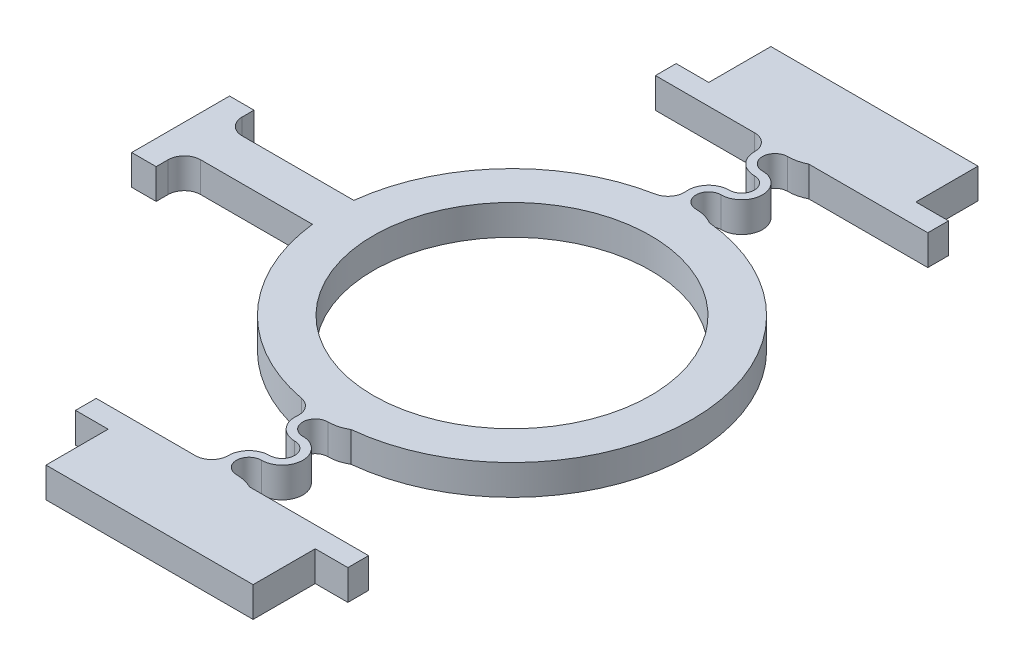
ISO-10303-21;
HEADER;
FILE_DESCRIPTION(('STEP AP214'),'2;1');
FILE_NAME('part.step','',(''),(''),'','','');
FILE_SCHEMA(('AUTOMOTIVE_DESIGN { 1 0 10303 214 1 1 1 1 }'));
ENDSEC;
DATA;
#1=APPLICATION_CONTEXT('core data for automotive mechanical design processes');
#2=APPLICATION_PROTOCOL_DEFINITION('international standard','automotive_design',2000,#1);
#3=PRODUCT_CONTEXT('',#1,'mechanical');
#4=PRODUCT('Part','Part','',(#3));
#5=PRODUCT_RELATED_PRODUCT_CATEGORY('part','',(#4));
#6=PRODUCT_DEFINITION_FORMATION('','',#4);
#7=PRODUCT_DEFINITION_CONTEXT('part definition',#1,'design');
#8=PRODUCT_DEFINITION('design','',#6,#7);
#9=PRODUCT_DEFINITION_SHAPE('','',#8);
#10=(LENGTH_UNIT() NAMED_UNIT(*) SI_UNIT(.MILLI.,.METRE.));
#11=(NAMED_UNIT(*) PLANE_ANGLE_UNIT() SI_UNIT($,.RADIAN.));
#12=(NAMED_UNIT(*) SI_UNIT($,.STERADIAN.) SOLID_ANGLE_UNIT());
#13=UNCERTAINTY_MEASURE_WITH_UNIT(LENGTH_MEASURE(1.E-05),#10,'distance_accuracy_value','');
#14=(GEOMETRIC_REPRESENTATION_CONTEXT(3) GLOBAL_UNCERTAINTY_ASSIGNED_CONTEXT((#13)) GLOBAL_UNIT_ASSIGNED_CONTEXT((#10,
#11,#12)) REPRESENTATION_CONTEXT('',''));
#15=CARTESIAN_POINT('',(0.,0.,0.));
#16=DIRECTION('',(0.,0.,1.));
#17=DIRECTION('',(1.,0.,0.));
#18=AXIS2_PLACEMENT_3D('',#15,#16,#17);
#19=CARTESIAN_POINT('',(6.35,-17.8855896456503,17.145));
#20=DIRECTION('',(-1.,0.,0.));
#21=DIRECTION('',(0.,0.,1.));
#22=AXIS2_PLACEMENT_3D('',#19,#20,#21);
#23=PLANE('',#22);
#24=DIRECTION('',(0.,-1.,0.));
#25=VECTOR('',#24,1.);
#26=CARTESIAN_POINT('',(6.35,-17.8855896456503,18.415));
#27=LINE('',#26,#25);
#28=CARTESIAN_POINT('',(6.35,0.925,18.415));
#29=VERTEX_POINT('',#28);
#30=CARTESIAN_POINT('',(6.35,-0.924999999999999,18.415));
#31=VERTEX_POINT('',#30);
#32=EDGE_CURVE('E404',#29,#31,#27,.T.);
#33=ORIENTED_EDGE('',*,*,#32,.F.);
#34=DIRECTION('',(0.,0.,1.));
#35=VECTOR('',#34,1.);
#36=CARTESIAN_POINT('',(6.35,0.925,17.145));
#37=LINE('',#36,#35);
#38=CARTESIAN_POINT('',(6.35,0.925,22.225));
#39=VERTEX_POINT('',#38);
#40=EDGE_CURVE('E497',#29,#39,#37,.T.);
#41=ORIENTED_EDGE('',*,*,#40,.T.);
#42=DIRECTION('',(0.,1.,0.));
#43=VECTOR('',#42,1.);
#44=CARTESIAN_POINT('',(6.35,-17.8855896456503,22.225));
#45=LINE('',#44,#43);
#46=CARTESIAN_POINT('',(6.35,-0.924999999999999,22.225));
#47=VERTEX_POINT('',#46);
#48=EDGE_CURVE('E546',#47,#39,#45,.T.);
#49=ORIENTED_EDGE('',*,*,#48,.F.);
#50=DIRECTION('',(0.,0.,-1.));
#51=VECTOR('',#50,1.);
#52=CARTESIAN_POINT('',(6.35,-0.924999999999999,17.145));
#53=LINE('',#52,#51);
#54=EDGE_CURVE('E459',#47,#31,#53,.T.);
#55=ORIENTED_EDGE('',*,*,#54,.T.);
#56=EDGE_LOOP('',(#33,#41,#49,#55));
#57=FACE_BOUND('',#56,.T.);
#58=ADVANCED_FACE('F32',(#57),#23,.F.);
#59=CARTESIAN_POINT('',(-6.35,-17.8855896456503,22.225));
#60=DIRECTION('',(1.,0.,0.));
#61=DIRECTION('',(0.,0.,-1.));
#62=AXIS2_PLACEMENT_3D('',#59,#60,#61);
#63=PLANE('',#62);
#64=DIRECTION('',(0.,1.,0.));
#65=VECTOR('',#64,1.);
#66=CARTESIAN_POINT('',(-6.35,-17.8855896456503,18.415));
#67=LINE('',#66,#65);
#68=CARTESIAN_POINT('',(-6.35,-0.924999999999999,18.415));
#69=VERTEX_POINT('',#68);
#70=CARTESIAN_POINT('',(-6.35,0.925,18.415));
#71=VERTEX_POINT('',#70);
#72=EDGE_CURVE('E707',#69,#71,#67,.T.);
#73=ORIENTED_EDGE('',*,*,#72,.F.);
#74=DIRECTION('',(0.,0.,1.));
#75=VECTOR('',#74,1.);
#76=CARTESIAN_POINT('',(-6.35,-0.924999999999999,22.225));
#77=LINE('',#76,#75);
#78=CARTESIAN_POINT('',(-6.35,-0.924999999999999,22.225));
#79=VERTEX_POINT('',#78);
#80=EDGE_CURVE('E490',#69,#79,#77,.T.);
#81=ORIENTED_EDGE('',*,*,#80,.T.);
#82=DIRECTION('',(0.,1.,0.));
#83=VECTOR('',#82,1.);
#84=CARTESIAN_POINT('',(-6.35,-17.8855896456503,22.225));
#85=LINE('',#84,#83);
#86=CARTESIAN_POINT('',(-6.35,0.925,22.225));
#87=VERTEX_POINT('',#86);
#88=EDGE_CURVE('E527',#79,#87,#85,.T.);
#89=ORIENTED_EDGE('',*,*,#88,.T.);
#90=DIRECTION('',(0.,0.,-1.));
#91=VECTOR('',#90,1.);
#92=CARTESIAN_POINT('',(-6.35,0.925,22.225));
#93=LINE('',#92,#91);
#94=EDGE_CURVE('E458',#87,#71,#93,.T.);
#95=ORIENTED_EDGE('',*,*,#94,.T.);
#96=EDGE_LOOP('',(#73,#81,#89,#95));
#97=FACE_BOUND('',#96,.T.);
#98=ADVANCED_FACE('F759',(#97),#63,.F.);
#99=CARTESIAN_POINT('',(0.,0.925,0.));
#100=DIRECTION('',(0.,-1.,0.));
#101=DIRECTION('',(0.,0.,-1.));
#102=AXIS2_PLACEMENT_3D('',#99,#100,#101);
#103=CYLINDRICAL_SURFACE('',#102,11.04);
#104=DIRECTION('',(0.,1.,0.));
#105=VECTOR('',#104,1.);
#106=CARTESIAN_POINT('',(1.11561652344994,-17.8855896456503,10.983487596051));
#107=LINE('',#106,#105);
#108=CARTESIAN_POINT('',(1.11561652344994,-0.924999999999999,10.983487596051));
#109=VERTEX_POINT('',#108);
#110=CARTESIAN_POINT('',(1.11561652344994,0.925,10.983487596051));
#111=VERTEX_POINT('',#110);
#112=EDGE_CURVE('E533',#109,#111,#107,.T.);
#113=ORIENTED_EDGE('',*,*,#112,.F.);
#114=CARTESIAN_POINT('',(0.,-0.925,0.));
#115=DIRECTION('',(0.,1.,0.));
#116=DIRECTION('',(0.,0.,1.));
#117=AXIS2_PLACEMENT_3D('',#114,#115,#116);
#118=CIRCLE('',#117,11.04);
#119=CARTESIAN_POINT('',(1.11561652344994,-0.925,-10.983487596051));
#120=VERTEX_POINT('',#119);
#121=EDGE_CURVE('E661',#109,#120,#118,.T.);
#122=ORIENTED_EDGE('',*,*,#121,.T.);
#123=DIRECTION('',(0.,1.,0.));
#124=VECTOR('',#123,1.);
#125=CARTESIAN_POINT('',(1.11561652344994,-17.8855896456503,-10.983487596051));
#126=LINE('',#125,#124);
#127=CARTESIAN_POINT('',(1.11561652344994,0.925,-10.983487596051));
#128=VERTEX_POINT('',#127);
#129=EDGE_CURVE('E631',#120,#128,#126,.T.);
#130=ORIENTED_EDGE('',*,*,#129,.T.);
#131=CARTESIAN_POINT('',(0.,0.925,0.));
#132=DIRECTION('',(0.,1.,0.));
#133=DIRECTION('',(0.,0.,1.));
#134=AXIS2_PLACEMENT_3D('',#131,#132,#133);
#135=CIRCLE('',#134,11.04);
#136=EDGE_CURVE('E651',#111,#128,#135,.T.);
#137=ORIENTED_EDGE('',*,*,#136,.F.);
#138=EDGE_LOOP('',(#113,#122,#130,#137));
#139=FACE_BOUND('',#138,.T.);
#140=ADVANCED_FACE('F765',(#139),#103,.T.);
#141=CARTESIAN_POINT('',(-10.9667087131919,-0.925,1.26999999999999));
#142=VERTEX_POINT('',#141);
#143=CARTESIAN_POINT('',(-2.06838051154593,-0.925,10.8445102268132));
#144=VERTEX_POINT('',#143);
#145=EDGE_CURVE('E658',#142,#144,#118,.T.);
#146=ORIENTED_EDGE('',*,*,#145,.T.);
#147=DIRECTION('',(0.,-1.,0.));
#148=VECTOR('',#147,1.);
#149=CARTESIAN_POINT('',(-2.06838051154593,0.925,10.8445102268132));
#150=LINE('',#149,#148);
#151=CARTESIAN_POINT('',(-2.06838051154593,0.925,10.8445102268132));
#152=VERTEX_POINT('',#151);
#153=EDGE_CURVE('E674',#144,#152,#150,.F.);
#154=ORIENTED_EDGE('',*,*,#153,.T.);
#155=CARTESIAN_POINT('',(-10.9667087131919,0.925,1.26999999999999));
#156=VERTEX_POINT('',#155);
#157=EDGE_CURVE('E647',#156,#152,#135,.T.);
#158=ORIENTED_EDGE('',*,*,#157,.F.);
#159=DIRECTION('',(0.,-1.,0.));
#160=VECTOR('',#159,1.);
#161=CARTESIAN_POINT('',(-10.9667087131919,0.925,1.26999999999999));
#162=LINE('',#161,#160);
#163=EDGE_CURVE('E666',#156,#142,#162,.T.);
#164=ORIENTED_EDGE('',*,*,#163,.T.);
#165=EDGE_LOOP('',(#146,#154,#158,#164));
#166=FACE_BOUND('',#165,.T.);
#167=ADVANCED_FACE('F835',(#166),#103,.T.);
#168=CARTESIAN_POINT('',(0.,0.925,0.));
#169=DIRECTION('',(0.,1.,0.));
#170=DIRECTION('',(0.,0.,1.));
#171=AXIS2_PLACEMENT_3D('',#168,#169,#170);
#172=PLANE('',#171);
#173=DIRECTION('',(-1.,0.,0.));
#174=VECTOR('',#173,1.);
#175=CARTESIAN_POINT('',(-10.9667087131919,0.925,-1.27));
#176=LINE('',#175,#174);
#177=CARTESIAN_POINT('',(-10.9667087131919,0.925,-1.27));
#178=VERTEX_POINT('',#177);
#179=CARTESIAN_POINT('',(-17.82,0.925,-1.27));
#180=VERTEX_POINT('',#179);
#181=EDGE_CURVE('E650',#178,#180,#176,.T.);
#182=ORIENTED_EDGE('',*,*,#181,.T.);
#183=CARTESIAN_POINT('',(-17.82,0.925,-2.27));
#184=DIRECTION('',(0.,1.,0.));
#185=DIRECTION('',(0.,0.,1.));
#186=AXIS2_PLACEMENT_3D('',#183,#184,#185);
#187=CIRCLE('',#186,1.);
#188=CARTESIAN_POINT('',(-18.82,0.925,-2.27));
#189=VERTEX_POINT('',#188);
#190=EDGE_CURVE('E40',#180,#189,#187,.F.);
#191=ORIENTED_EDGE('',*,*,#190,.T.);
#192=DIRECTION('',(0.,0.,-1.));
#193=VECTOR('',#192,1.);
#194=CARTESIAN_POINT('',(-18.82,0.925,-3.));
#195=LINE('',#194,#193);
#196=CARTESIAN_POINT('',(-18.82,0.925,-3.));
#197=VERTEX_POINT('',#196);
#198=EDGE_CURVE('E374',#189,#197,#195,.T.);
#199=ORIENTED_EDGE('',*,*,#198,.T.);
#200=DIRECTION('',(-1.,0.,0.));
#201=VECTOR('',#200,1.);
#202=CARTESIAN_POINT('',(-18.82,0.925,-3.));
#203=LINE('',#202,#201);
#204=CARTESIAN_POINT('',(-20.32,0.925,-3.));
#205=VERTEX_POINT('',#204);
#206=EDGE_CURVE('E355',#197,#205,#203,.T.);
#207=ORIENTED_EDGE('',*,*,#206,.T.);
#208=DIRECTION('',(0.,0.,1.));
#209=VECTOR('',#208,1.);
#210=CARTESIAN_POINT('',(-20.32,0.925,-1.27));
#211=LINE('',#210,#209);
#212=CARTESIAN_POINT('',(-20.32,0.925,3.));
#213=VERTEX_POINT('',#212);
#214=EDGE_CURVE('E347',#205,#213,#211,.T.);
#215=ORIENTED_EDGE('',*,*,#214,.T.);
#216=DIRECTION('',(1.,0.,0.));
#217=VECTOR('',#216,1.);
#218=CARTESIAN_POINT('',(-18.82,0.925,3.));
#219=LINE('',#218,#217);
#220=CARTESIAN_POINT('',(-18.82,0.925,3.));
#221=VERTEX_POINT('',#220);
#222=EDGE_CURVE('E353',#213,#221,#219,.T.);
#223=ORIENTED_EDGE('',*,*,#222,.T.);
#224=CARTESIAN_POINT('',(-18.82,0.925,2.27));
#225=VERTEX_POINT('',#224);
#226=EDGE_CURVE('E376',#221,#225,#195,.T.);
#227=ORIENTED_EDGE('',*,*,#226,.T.);
#228=CARTESIAN_POINT('',(-17.82,0.925,2.27));
#229=DIRECTION('',(0.,1.,0.));
#230=DIRECTION('',(0.,0.,1.));
#231=AXIS2_PLACEMENT_3D('',#228,#229,#230);
#232=CIRCLE('',#231,1.);
#233=CARTESIAN_POINT('',(-17.82,0.925,1.27));
#234=VERTEX_POINT('',#233);
#235=EDGE_CURVE('E721',#225,#234,#232,.F.);
#236=ORIENTED_EDGE('',*,*,#235,.T.);
#237=DIRECTION('',(1.,0.,0.));
#238=VECTOR('',#237,1.);
#239=CARTESIAN_POINT('',(-20.32,0.925,1.27));
#240=LINE('',#239,#238);
#241=EDGE_CURVE('E359',#234,#156,#240,.T.);
#242=ORIENTED_EDGE('',*,*,#241,.T.);
#243=ORIENTED_EDGE('',*,*,#157,.T.);
#244=CARTESIAN_POINT('',(-2.25573381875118,0.924999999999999,11.8268028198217));
#245=DIRECTION('',(0.,1.,0.));
#246=DIRECTION('',(0.,0.,1.));
#247=AXIS2_PLACEMENT_3D('',#244,#245,#246);
#248=CIRCLE('',#247,1.);
#249=CARTESIAN_POINT('',(-1.26092287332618,0.925,11.9285435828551));
#250=VERTEX_POINT('',#249);
#251=EDGE_CURVE('E693',#152,#250,#248,.F.);
#252=ORIENTED_EDGE('',*,*,#251,.T.);
#253=CARTESIAN_POINT('',(0.,0.925,12.0575));
#254=DIRECTION('',(0.,-1.,0.));
#255=DIRECTION('',(0.,0.,-1.));
#256=AXIS2_PLACEMENT_3D('',#253,#254,#255);
#257=CIRCLE('',#256,1.2675);
#258=CARTESIAN_POINT('',(0.,0.925,13.325));
#259=VERTEX_POINT('',#258);
#260=EDGE_CURVE('E516',#259,#250,#257,.T.);
#261=ORIENTED_EDGE('',*,*,#260,.F.);
#262=CARTESIAN_POINT('',(0.,0.925,14.0925));
#263=DIRECTION('',(0.,1.,0.));
#264=DIRECTION('',(0.,0.,-1.));
#265=AXIS2_PLACEMENT_3D('',#262,#263,#264);
#266=CIRCLE('',#265,0.767499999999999);
#267=CARTESIAN_POINT('',(0.,0.925,14.86));
#268=VERTEX_POINT('',#267);
#269=EDGE_CURVE('E519',#268,#259,#266,.T.);
#270=ORIENTED_EDGE('',*,*,#269,.F.);
#271=CARTESIAN_POINT('',(0.,0.925,16.1275));
#272=DIRECTION('',(0.,-1.,0.));
#273=DIRECTION('',(0.,0.,-1.));
#274=AXIS2_PLACEMENT_3D('',#271,#272,#273);
#275=CIRCLE('',#274,1.2675);
#276=CARTESIAN_POINT('',(-1.26746225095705,0.925,16.1372822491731));
#277=VERTEX_POINT('',#276);
#278=EDGE_CURVE('E522',#277,#268,#275,.T.);
#279=ORIENTED_EDGE('',*,*,#278,.F.);
#280=CARTESIAN_POINT('',(-2.26743246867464,0.924999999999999,16.145));
#281=DIRECTION('',(0.,1.,0.));
#282=DIRECTION('',(0.,0.,1.));
#283=AXIS2_PLACEMENT_3D('',#280,#281,#282);
#284=CIRCLE('',#283,1.);
#285=CARTESIAN_POINT('',(-2.26743246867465,0.925,17.145));
#286=VERTEX_POINT('',#285);
#287=EDGE_CURVE('E689',#277,#286,#284,.F.);
#288=ORIENTED_EDGE('',*,*,#287,.T.);
#289=DIRECTION('',(1.,0.,0.));
#290=VECTOR('',#289,1.);
#291=CARTESIAN_POINT('',(-6.35,0.925,17.145));
#292=LINE('',#291,#290);
#293=CARTESIAN_POINT('',(-8.35,0.925,17.145));
#294=VERTEX_POINT('',#293);
#295=EDGE_CURVE('E524',#294,#286,#292,.T.);
#296=ORIENTED_EDGE('',*,*,#295,.F.);
#297=DIRECTION('',(0.,0.,-1.));
#298=VECTOR('',#297,1.);
#299=CARTESIAN_POINT('',(-8.35,0.925,18.415));
#300=LINE('',#299,#298);
#301=CARTESIAN_POINT('',(-8.35,0.925,18.415));
#302=VERTEX_POINT('',#301);
#303=EDGE_CURVE('E407',#302,#294,#300,.T.);
#304=ORIENTED_EDGE('',*,*,#303,.F.);
#305=DIRECTION('',(-1.,0.,0.));
#306=VECTOR('',#305,1.);
#307=CARTESIAN_POINT('',(-8.35,0.925,18.415));
#308=LINE('',#307,#306);
#309=EDGE_CURVE('E410',#71,#302,#308,.T.);
#310=ORIENTED_EDGE('',*,*,#309,.F.);
#311=ORIENTED_EDGE('',*,*,#94,.F.);
#312=DIRECTION('',(-1.,0.,0.));
#313=VECTOR('',#312,1.);
#314=CARTESIAN_POINT('',(6.35,0.925,22.225));
#315=LINE('',#314,#313);
#316=EDGE_CURVE('E494',#39,#87,#315,.T.);
#317=ORIENTED_EDGE('',*,*,#316,.F.);
#318=ORIENTED_EDGE('',*,*,#40,.F.);
#319=CARTESIAN_POINT('',(8.35,0.925,18.415));
#320=VERTEX_POINT('',#319);
#321=EDGE_CURVE('E411',#320,#29,#308,.T.);
#322=ORIENTED_EDGE('',*,*,#321,.F.);
#323=DIRECTION('',(0.,0.,1.));
#324=VECTOR('',#323,1.);
#325=CARTESIAN_POINT('',(8.35,0.925,18.415));
#326=LINE('',#325,#324);
#327=CARTESIAN_POINT('',(8.35,0.925,17.145));
#328=VERTEX_POINT('',#327);
#329=EDGE_CURVE('E392',#328,#320,#326,.T.);
#330=ORIENTED_EDGE('',*,*,#329,.F.);
#331=DIRECTION('',(1.,0.,0.));
#332=VECTOR('',#331,1.);
#333=CARTESIAN_POINT('',(1.0543779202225,0.925,17.145));
#334=LINE('',#333,#332);
#335=CARTESIAN_POINT('',(1.0543779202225,0.925,17.145));
#336=VERTEX_POINT('',#335);
#337=EDGE_CURVE('E499',#336,#328,#334,.T.);
#338=ORIENTED_EDGE('',*,*,#337,.F.);
#339=CARTESIAN_POINT('',(0.,0.925,19.2434255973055));
#340=DIRECTION('',(0.,-1.,0.));
#341=DIRECTION('',(0.,0.,-1.));
#342=AXIS2_PLACEMENT_3D('',#339,#340,#341);
#343=CIRCLE('',#342,2.34842559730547);
#344=CARTESIAN_POINT('',(0.,0.925,16.895));
#345=VERTEX_POINT('',#344);
#346=EDGE_CURVE('E501',#345,#336,#343,.T.);
#347=ORIENTED_EDGE('',*,*,#346,.F.);
#348=CARTESIAN_POINT('',(0.,0.925,16.1275));
#349=DIRECTION('',(0.,1.,0.));
#350=DIRECTION('',(0.,0.,-1.));
#351=AXIS2_PLACEMENT_3D('',#348,#349,#350);
#352=CIRCLE('',#351,0.767499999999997);
#353=CARTESIAN_POINT('',(0.,0.925,15.36));
#354=VERTEX_POINT('',#353);
#355=EDGE_CURVE('E504',#354,#345,#352,.T.);
#356=ORIENTED_EDGE('',*,*,#355,.F.);
#357=CARTESIAN_POINT('',(0.,0.925,14.0925));
#358=DIRECTION('',(0.,-1.,0.));
#359=DIRECTION('',(0.,0.,-1.));
#360=AXIS2_PLACEMENT_3D('',#357,#358,#359);
#361=CIRCLE('',#360,1.2675);
#362=CARTESIAN_POINT('',(0.,0.925,12.825));
#363=VERTEX_POINT('',#362);
#364=EDGE_CURVE('E507',#363,#354,#361,.T.);
#365=ORIENTED_EDGE('',*,*,#364,.F.);
#366=CARTESIAN_POINT('',(0.,0.925,12.0575));
#367=DIRECTION('',(0.,1.,0.));
#368=DIRECTION('',(0.,0.,-1.));
#369=AXIS2_PLACEMENT_3D('',#366,#367,#368);
#370=CIRCLE('',#369,0.767499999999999);
#371=CARTESIAN_POINT('',(0.,0.925,11.29));
#372=VERTEX_POINT('',#371);
#373=EDGE_CURVE('E510',#372,#363,#370,.T.);
#374=ORIENTED_EDGE('',*,*,#373,.F.);
#375=CARTESIAN_POINT('',(0.,0.925,9.10648301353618));
#376=DIRECTION('',(0.,-1.,0.));
#377=DIRECTION('',(0.,0.,-1.));
#378=AXIS2_PLACEMENT_3D('',#375,#376,#377);
#379=CIRCLE('',#378,2.18351698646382);
#380=EDGE_CURVE('E513',#111,#372,#379,.T.);
#381=ORIENTED_EDGE('',*,*,#380,.F.);
#382=ORIENTED_EDGE('',*,*,#136,.T.);
#383=CARTESIAN_POINT('',(0.,0.925,-9.10648301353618));
#384=DIRECTION('',(0.,1.,0.));
#385=DIRECTION('',(0.,0.,1.));
#386=AXIS2_PLACEMENT_3D('',#383,#384,#385);
#387=CIRCLE('',#386,2.18351698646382);
#388=CARTESIAN_POINT('',(0.,0.925,-11.29));
#389=VERTEX_POINT('',#388);
#390=EDGE_CURVE('E594',#128,#389,#387,.T.);
#391=ORIENTED_EDGE('',*,*,#390,.T.);
#392=CARTESIAN_POINT('',(0.,0.925,-12.0575));
#393=DIRECTION('',(0.,-1.,0.));
#394=DIRECTION('',(0.,0.,1.));
#395=AXIS2_PLACEMENT_3D('',#392,#393,#394);
#396=CIRCLE('',#395,0.767499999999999);
#397=CARTESIAN_POINT('',(0.,0.925,-12.825));
#398=VERTEX_POINT('',#397);
#399=EDGE_CURVE('E597',#389,#398,#396,.T.);
#400=ORIENTED_EDGE('',*,*,#399,.T.);
#401=CARTESIAN_POINT('',(0.,0.925,-14.0925));
#402=DIRECTION('',(0.,1.,0.));
#403=DIRECTION('',(0.,0.,1.));
#404=AXIS2_PLACEMENT_3D('',#401,#402,#403);
#405=CIRCLE('',#404,1.2675);
#406=CARTESIAN_POINT('',(0.,0.925,-15.36));
#407=VERTEX_POINT('',#406);
#408=EDGE_CURVE('E600',#398,#407,#405,.T.);
#409=ORIENTED_EDGE('',*,*,#408,.T.);
#410=CARTESIAN_POINT('',(0.,0.925,-16.1275));
#411=DIRECTION('',(0.,-1.,0.));
#412=DIRECTION('',(0.,0.,1.));
#413=AXIS2_PLACEMENT_3D('',#410,#411,#412);
#414=CIRCLE('',#413,0.767499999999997);
#415=CARTESIAN_POINT('',(0.,0.925,-16.895));
#416=VERTEX_POINT('',#415);
#417=EDGE_CURVE('E603',#407,#416,#414,.T.);
#418=ORIENTED_EDGE('',*,*,#417,.T.);
#419=CARTESIAN_POINT('',(0.,0.925,-19.2434255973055));
#420=DIRECTION('',(0.,1.,0.));
#421=DIRECTION('',(0.,0.,1.));
#422=AXIS2_PLACEMENT_3D('',#419,#420,#421);
#423=CIRCLE('',#422,2.34842559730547);
#424=CARTESIAN_POINT('',(1.0543779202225,0.925,-17.145));
#425=VERTEX_POINT('',#424);
#426=EDGE_CURVE('E606',#416,#425,#423,.T.);
#427=ORIENTED_EDGE('',*,*,#426,.T.);
#428=DIRECTION('',(1.,0.,0.));
#429=VECTOR('',#428,1.);
#430=CARTESIAN_POINT('',(1.0543779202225,0.925,-17.145));
#431=LINE('',#430,#429);
#432=CARTESIAN_POINT('',(8.35,0.925,-17.145));
#433=VERTEX_POINT('',#432);
#434=EDGE_CURVE('E609',#425,#433,#431,.T.);
#435=ORIENTED_EDGE('',*,*,#434,.T.);
#436=DIRECTION('',(0.,0.,-1.));
#437=VECTOR('',#436,1.);
#438=CARTESIAN_POINT('',(8.35,0.925,-18.415));
#439=LINE('',#438,#437);
#440=CARTESIAN_POINT('',(8.35,0.925,-18.415));
#441=VERTEX_POINT('',#440);
#442=EDGE_CURVE('E426',#433,#441,#439,.T.);
#443=ORIENTED_EDGE('',*,*,#442,.T.);
#444=DIRECTION('',(-1.,0.,0.));
#445=VECTOR('',#444,1.);
#446=CARTESIAN_POINT('',(-8.35,0.925,-18.415));
#447=LINE('',#446,#445);
#448=CARTESIAN_POINT('',(6.35,0.925,-18.415));
#449=VERTEX_POINT('',#448);
#450=EDGE_CURVE('E437',#441,#449,#447,.T.);
#451=ORIENTED_EDGE('',*,*,#450,.T.);
#452=DIRECTION('',(0.,0.,-1.));
#453=VECTOR('',#452,1.);
#454=CARTESIAN_POINT('',(6.35,0.925,-17.145));
#455=LINE('',#454,#453);
#456=CARTESIAN_POINT('',(6.35,0.925,-22.225));
#457=VERTEX_POINT('',#456);
#458=EDGE_CURVE('E611',#449,#457,#455,.T.);
#459=ORIENTED_EDGE('',*,*,#458,.T.);
#460=DIRECTION('',(-1.,0.,0.));
#461=VECTOR('',#460,1.);
#462=CARTESIAN_POINT('',(6.35,0.925,-22.225));
#463=LINE('',#462,#461);
#464=CARTESIAN_POINT('',(-6.35,0.925,-22.225));
#465=VERTEX_POINT('',#464);
#466=EDGE_CURVE('E613',#457,#465,#463,.T.);
#467=ORIENTED_EDGE('',*,*,#466,.T.);
#468=DIRECTION('',(0.,0.,1.));
#469=VECTOR('',#468,1.);
#470=CARTESIAN_POINT('',(-6.35,0.925,-22.225));
#471=LINE('',#470,#469);
#472=CARTESIAN_POINT('',(-6.35,0.925,-18.415));
#473=VERTEX_POINT('',#472);
#474=EDGE_CURVE('E492',#465,#473,#471,.T.);
#475=ORIENTED_EDGE('',*,*,#474,.T.);
#476=CARTESIAN_POINT('',(-8.35,0.925,-18.415));
#477=VERTEX_POINT('',#476);
#478=EDGE_CURVE('E436',#473,#477,#447,.T.);
#479=ORIENTED_EDGE('',*,*,#478,.T.);
#480=DIRECTION('',(0.,0.,1.));
#481=VECTOR('',#480,1.);
#482=CARTESIAN_POINT('',(-8.35,0.925,-18.415));
#483=LINE('',#482,#481);
#484=CARTESIAN_POINT('',(-8.35,0.925,-17.145));
#485=VERTEX_POINT('',#484);
#486=EDGE_CURVE('E440',#477,#485,#483,.T.);
#487=ORIENTED_EDGE('',*,*,#486,.T.);
#488=DIRECTION('',(1.,0.,0.));
#489=VECTOR('',#488,1.);
#490=CARTESIAN_POINT('',(-6.35,0.925,-17.145));
#491=LINE('',#490,#489);
#492=CARTESIAN_POINT('',(-2.26743246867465,0.925,-17.145));
#493=VERTEX_POINT('',#492);
#494=EDGE_CURVE('E583',#485,#493,#491,.T.);
#495=ORIENTED_EDGE('',*,*,#494,.T.);
#496=CARTESIAN_POINT('',(-2.26743246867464,0.924999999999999,-16.145));
#497=DIRECTION('',(0.,1.,0.));
#498=DIRECTION('',(0.,0.,1.));
#499=AXIS2_PLACEMENT_3D('',#496,#497,#498);
#500=CIRCLE('',#499,1.);
#501=CARTESIAN_POINT('',(-1.26746225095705,0.925,-16.1372822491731));
#502=VERTEX_POINT('',#501);
#503=EDGE_CURVE('E701',#493,#502,#500,.F.);
#504=ORIENTED_EDGE('',*,*,#503,.T.);
#505=CARTESIAN_POINT('',(0.,0.925,-16.1275));
#506=DIRECTION('',(0.,1.,0.));
#507=DIRECTION('',(0.,0.,1.));
#508=AXIS2_PLACEMENT_3D('',#505,#506,#507);
#509=CIRCLE('',#508,1.2675);
#510=CARTESIAN_POINT('',(0.,0.925,-14.86));
#511=VERTEX_POINT('',#510);
#512=EDGE_CURVE('E586',#502,#511,#509,.T.);
#513=ORIENTED_EDGE('',*,*,#512,.T.);
#514=CARTESIAN_POINT('',(0.,0.925,-14.0925));
#515=DIRECTION('',(0.,-1.,0.));
#516=DIRECTION('',(0.,0.,1.));
#517=AXIS2_PLACEMENT_3D('',#514,#515,#516);
#518=CIRCLE('',#517,0.767499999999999);
#519=CARTESIAN_POINT('',(0.,0.925,-13.325));
#520=VERTEX_POINT('',#519);
#521=EDGE_CURVE('E588',#511,#520,#518,.T.);
#522=ORIENTED_EDGE('',*,*,#521,.T.);
#523=CARTESIAN_POINT('',(0.,0.925,-12.0575));
#524=DIRECTION('',(0.,1.,0.));
#525=DIRECTION('',(0.,0.,1.));
#526=AXIS2_PLACEMENT_3D('',#523,#524,#525);
#527=CIRCLE('',#526,1.2675);
#528=CARTESIAN_POINT('',(-1.26092287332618,0.925,-11.9285435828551));
#529=VERTEX_POINT('',#528);
#530=EDGE_CURVE('E591',#520,#529,#527,.T.);
#531=ORIENTED_EDGE('',*,*,#530,.T.);
#532=CARTESIAN_POINT('',(-2.25573381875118,0.925,-11.8268028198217));
#533=DIRECTION('',(0.,1.,0.));
#534=DIRECTION('',(0.,0.,1.));
#535=AXIS2_PLACEMENT_3D('',#532,#533,#534);
#536=CIRCLE('',#535,1.);
#537=CARTESIAN_POINT('',(-2.06838051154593,0.925,-10.8445102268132));
#538=VERTEX_POINT('',#537);
#539=EDGE_CURVE('E697',#529,#538,#536,.F.);
#540=ORIENTED_EDGE('',*,*,#539,.T.);
#541=EDGE_CURVE('E646',#538,#178,#135,.T.);
#542=ORIENTED_EDGE('',*,*,#541,.T.);
#543=EDGE_LOOP('',(#182,#191,#199,#207,#215,#223,#227,#236,#242,#243,#252,#261,#270,#279,#288,
#296,#304,#310,#311,#317,#318,#322,#330,#338,#347,#356,#365,#374,#381,#382,#391,#400,#409,#418,
#427,#435,#443,#451,#459,#467,#475,#479,#487,#495,#504,#513,#522,#531,#540,#542));
#544=FACE_BOUND('',#543,.T.);
#545=CARTESIAN_POINT('',(0.,0.925,0.));
#546=DIRECTION('',(0.,1.,0.));
#547=DIRECTION('',(0.,0.,1.));
#548=AXIS2_PLACEMENT_3D('',#545,#546,#547);
#549=CIRCLE('',#548,8.5);
#550=CARTESIAN_POINT('',(0.,0.925,8.5));
#551=VERTEX_POINT('',#550);
#552=EDGE_CURVE('E640',#551,#551,#549,.T.);
#553=ORIENTED_EDGE('',*,*,#552,.F.);
#554=EDGE_LOOP('',(#553));
#555=FACE_BOUND('',#554,.T.);
#556=ADVANCED_FACE('F349',(#544,#555),#172,.T.);
#557=CARTESIAN_POINT('',(0.,-0.925,0.));
#558=DIRECTION('',(0.,1.,0.));
#559=DIRECTION('',(0.,0.,1.));
#560=AXIS2_PLACEMENT_3D('',#557,#558,#559);
#561=PLANE('',#560);
#562=DIRECTION('',(1.,0.,0.));
#563=VECTOR('',#562,1.);
#564=CARTESIAN_POINT('',(-20.32,-0.925,1.27));
#565=LINE('',#564,#563);
#566=CARTESIAN_POINT('',(-17.82,-0.925,1.27));
#567=VERTEX_POINT('',#566);
#568=EDGE_CURVE('E655',#567,#142,#565,.T.);
#569=ORIENTED_EDGE('',*,*,#568,.F.);
#570=CARTESIAN_POINT('',(-17.82,-0.925,2.27));
#571=DIRECTION('',(0.,1.,0.));
#572=DIRECTION('',(0.,0.,1.));
#573=AXIS2_PLACEMENT_3D('',#570,#571,#572);
#574=CIRCLE('',#573,1.);
#575=CARTESIAN_POINT('',(-18.82,-0.925,2.27));
#576=VERTEX_POINT('',#575);
#577=EDGE_CURVE('E719',#567,#576,#574,.T.);
#578=ORIENTED_EDGE('',*,*,#577,.T.);
#579=DIRECTION('',(0.,0.,1.));
#580=VECTOR('',#579,1.);
#581=CARTESIAN_POINT('',(-18.82,-0.925,-3.));
#582=LINE('',#581,#580);
#583=CARTESIAN_POINT('',(-18.82,-0.925,3.));
#584=VERTEX_POINT('',#583);
#585=EDGE_CURVE('E385',#576,#584,#582,.T.);
#586=ORIENTED_EDGE('',*,*,#585,.T.);
#587=DIRECTION('',(-1.,0.,0.));
#588=VECTOR('',#587,1.);
#589=CARTESIAN_POINT('',(-18.82,-0.925,3.));
#590=LINE('',#589,#588);
#591=CARTESIAN_POINT('',(-20.32,-0.925,3.));
#592=VERTEX_POINT('',#591);
#593=EDGE_CURVE('E390',#584,#592,#590,.T.);
#594=ORIENTED_EDGE('',*,*,#593,.T.);
#595=DIRECTION('',(0.,0.,1.));
#596=VECTOR('',#595,1.);
#597=CARTESIAN_POINT('',(-20.32,-0.925,-1.27));
#598=LINE('',#597,#596);
#599=CARTESIAN_POINT('',(-20.32,-0.925,-3.));
#600=VERTEX_POINT('',#599);
#601=EDGE_CURVE('E365',#600,#592,#598,.T.);
#602=ORIENTED_EDGE('',*,*,#601,.F.);
#603=DIRECTION('',(1.,0.,0.));
#604=VECTOR('',#603,1.);
#605=CARTESIAN_POINT('',(-18.82,-0.925,-3.));
#606=LINE('',#605,#604);
#607=CARTESIAN_POINT('',(-18.82,-0.925,-3.));
#608=VERTEX_POINT('',#607);
#609=EDGE_CURVE('E379',#600,#608,#606,.T.);
#610=ORIENTED_EDGE('',*,*,#609,.T.);
#611=CARTESIAN_POINT('',(-18.82,-0.925,-2.27));
#612=VERTEX_POINT('',#611);
#613=EDGE_CURVE('E740',#608,#612,#582,.T.);
#614=ORIENTED_EDGE('',*,*,#613,.T.);
#615=CARTESIAN_POINT('',(-17.82,-0.925,-2.27));
#616=DIRECTION('',(0.,1.,0.));
#617=DIRECTION('',(0.,0.,1.));
#618=AXIS2_PLACEMENT_3D('',#615,#616,#617);
#619=CIRCLE('',#618,1.);
#620=CARTESIAN_POINT('',(-17.82,-0.925,-1.27));
#621=VERTEX_POINT('',#620);
#622=EDGE_CURVE('E11',#612,#621,#619,.T.);
#623=ORIENTED_EDGE('',*,*,#622,.T.);
#624=DIRECTION('',(-1.,0.,0.));
#625=VECTOR('',#624,1.);
#626=CARTESIAN_POINT('',(-10.9667087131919,-0.925,-1.27));
#627=LINE('',#626,#625);
#628=CARTESIAN_POINT('',(-10.9667087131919,-0.925,-1.27));
#629=VERTEX_POINT('',#628);
#630=EDGE_CURVE('E360',#629,#621,#627,.T.);
#631=ORIENTED_EDGE('',*,*,#630,.F.);
#632=CARTESIAN_POINT('',(-2.06838051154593,-0.925,-10.8445102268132));
#633=VERTEX_POINT('',#632);
#634=EDGE_CURVE('E657',#633,#629,#118,.T.);
#635=ORIENTED_EDGE('',*,*,#634,.F.);
#636=CARTESIAN_POINT('',(-2.25573381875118,-0.925,-11.8268028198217));
#637=DIRECTION('',(0.,1.,0.));
#638=DIRECTION('',(0.,0.,1.));
#639=AXIS2_PLACEMENT_3D('',#636,#637,#638);
#640=CIRCLE('',#639,1.);
#641=CARTESIAN_POINT('',(-1.26092287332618,-0.924999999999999,-11.9285435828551));
#642=VERTEX_POINT('',#641);
#643=EDGE_CURVE('E699',#633,#642,#640,.T.);
#644=ORIENTED_EDGE('',*,*,#643,.T.);
#645=CARTESIAN_POINT('',(0.,-0.924999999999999,-12.0575));
#646=DIRECTION('',(0.,1.,0.));
#647=DIRECTION('',(0.,0.,1.));
#648=AXIS2_PLACEMENT_3D('',#645,#646,#647);
#649=CIRCLE('',#648,1.2675);
#650=CARTESIAN_POINT('',(0.,-0.924999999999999,-13.325));
#651=VERTEX_POINT('',#650);
#652=EDGE_CURVE('E558',#642,#651,#649,.F.);
#653=ORIENTED_EDGE('',*,*,#652,.T.);
#654=CARTESIAN_POINT('',(0.,-0.924999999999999,-14.0925));
#655=DIRECTION('',(0.,1.,0.));
#656=DIRECTION('',(0.,0.,1.));
#657=AXIS2_PLACEMENT_3D('',#654,#655,#656);
#658=CIRCLE('',#657,0.767499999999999);
#659=CARTESIAN_POINT('',(0.,-0.924999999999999,-14.86));
#660=VERTEX_POINT('',#659);
#661=EDGE_CURVE('E555',#651,#660,#658,.T.);
#662=ORIENTED_EDGE('',*,*,#661,.T.);
#663=CARTESIAN_POINT('',(0.,-0.924999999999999,-16.1275));
#664=DIRECTION('',(0.,1.,0.));
#665=DIRECTION('',(0.,0.,1.));
#666=AXIS2_PLACEMENT_3D('',#663,#664,#665);
#667=CIRCLE('',#666,1.2675);
#668=CARTESIAN_POINT('',(-1.26746225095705,-0.924999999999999,-16.1372822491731));
#669=VERTEX_POINT('',#668);
#670=EDGE_CURVE('E552',#660,#669,#667,.F.);
#671=ORIENTED_EDGE('',*,*,#670,.T.);
#672=CARTESIAN_POINT('',(-2.26743246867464,-0.924999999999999,-16.145));
#673=DIRECTION('',(0.,1.,0.));
#674=DIRECTION('',(0.,0.,1.));
#675=AXIS2_PLACEMENT_3D('',#672,#673,#674);
#676=CIRCLE('',#675,1.);
#677=CARTESIAN_POINT('',(-2.26743246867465,-0.924999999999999,-17.145));
#678=VERTEX_POINT('',#677);
#679=EDGE_CURVE('E703',#669,#678,#676,.T.);
#680=ORIENTED_EDGE('',*,*,#679,.T.);
#681=DIRECTION('',(-1.,0.,0.));
#682=VECTOR('',#681,1.);
#683=CARTESIAN_POINT('',(-6.35,-0.924999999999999,-17.145));
#684=LINE('',#683,#682);
#685=CARTESIAN_POINT('',(-8.35,-0.924999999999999,-17.145));
#686=VERTEX_POINT('',#685);
#687=EDGE_CURVE('E580',#678,#686,#684,.T.);
#688=ORIENTED_EDGE('',*,*,#687,.T.);
#689=DIRECTION('',(0.,0.,-1.));
#690=VECTOR('',#689,1.);
#691=CARTESIAN_POINT('',(-8.35,-0.924999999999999,-18.415));
#692=LINE('',#691,#690);
#693=CARTESIAN_POINT('',(-8.35,-0.924999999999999,-18.415));
#694=VERTEX_POINT('',#693);
#695=EDGE_CURVE('E427',#686,#694,#692,.T.);
#696=ORIENTED_EDGE('',*,*,#695,.T.);
#697=DIRECTION('',(1.,0.,0.));
#698=VECTOR('',#697,1.);
#699=CARTESIAN_POINT('',(-8.35,-0.924999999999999,-18.415));
#700=LINE('',#699,#698);
#701=CARTESIAN_POINT('',(-6.35,-0.924999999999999,-18.415));
#702=VERTEX_POINT('',#701);
#703=EDGE_CURVE('E453',#694,#702,#700,.T.);
#704=ORIENTED_EDGE('',*,*,#703,.T.);
#705=DIRECTION('',(0.,0.,-1.));
#706=VECTOR('',#705,1.);
#707=CARTESIAN_POINT('',(-6.35,-0.924999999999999,-22.225));
#708=LINE('',#707,#706);
#709=CARTESIAN_POINT('',(-6.35,-0.924999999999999,-22.225));
#710=VERTEX_POINT('',#709);
#711=EDGE_CURVE('E578',#702,#710,#708,.T.);
#712=ORIENTED_EDGE('',*,*,#711,.T.);
#713=DIRECTION('',(1.,0.,0.));
#714=VECTOR('',#713,1.);
#715=CARTESIAN_POINT('',(6.35,-0.924999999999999,-22.225));
#716=LINE('',#715,#714);
#717=CARTESIAN_POINT('',(6.35,-0.924999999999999,-22.225));
#718=VERTEX_POINT('',#717);
#719=EDGE_CURVE('E576',#710,#718,#716,.T.);
#720=ORIENTED_EDGE('',*,*,#719,.T.);
#721=DIRECTION('',(0.,0.,1.));
#722=VECTOR('',#721,1.);
#723=CARTESIAN_POINT('',(6.35,-0.924999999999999,-17.145));
#724=LINE('',#723,#722);
#725=CARTESIAN_POINT('',(6.35,-0.924999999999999,-18.415));
#726=VERTEX_POINT('',#725);
#727=EDGE_CURVE('E573',#718,#726,#724,.T.);
#728=ORIENTED_EDGE('',*,*,#727,.T.);
#729=CARTESIAN_POINT('',(8.35,-0.924999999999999,-18.415));
#730=VERTEX_POINT('',#729);
#731=EDGE_CURVE('E433',#726,#730,#700,.T.);
#732=ORIENTED_EDGE('',*,*,#731,.T.);
#733=DIRECTION('',(0.,0.,1.));
#734=VECTOR('',#733,1.);
#735=CARTESIAN_POINT('',(8.35,-0.924999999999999,-18.415));
#736=LINE('',#735,#734);
#737=CARTESIAN_POINT('',(8.35,-0.924999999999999,-17.145));
#738=VERTEX_POINT('',#737);
#739=EDGE_CURVE('E429',#730,#738,#736,.T.);
#740=ORIENTED_EDGE('',*,*,#739,.T.);
#741=DIRECTION('',(-1.,0.,0.));
#742=VECTOR('',#741,1.);
#743=CARTESIAN_POINT('',(1.0543779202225,-0.924999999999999,-17.145));
#744=LINE('',#743,#742);
#745=CARTESIAN_POINT('',(1.0543779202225,-0.924999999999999,-17.145));
#746=VERTEX_POINT('',#745);
#747=EDGE_CURVE('E571',#738,#746,#744,.T.);
#748=ORIENTED_EDGE('',*,*,#747,.T.);
#749=CARTESIAN_POINT('',(0.,-0.924999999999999,-19.2434255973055));
#750=DIRECTION('',(0.,1.,0.));
#751=DIRECTION('',(0.,0.,1.));
#752=AXIS2_PLACEMENT_3D('',#749,#750,#751);
#753=CIRCLE('',#752,2.34842559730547);
#754=CARTESIAN_POINT('',(0.,-0.924999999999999,-16.895));
#755=VERTEX_POINT('',#754);
#756=EDGE_CURVE('E569',#746,#755,#753,.F.);
#757=ORIENTED_EDGE('',*,*,#756,.T.);
#758=CARTESIAN_POINT('',(0.,-0.924999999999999,-16.1275));
#759=DIRECTION('',(0.,1.,0.));
#760=DIRECTION('',(0.,0.,1.));
#761=AXIS2_PLACEMENT_3D('',#758,#759,#760);
#762=CIRCLE('',#761,0.767499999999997);
#763=CARTESIAN_POINT('',(0.,-0.924999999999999,-15.36));
#764=VERTEX_POINT('',#763);
#765=EDGE_CURVE('E567',#755,#764,#762,.T.);
#766=ORIENTED_EDGE('',*,*,#765,.T.);
#767=CARTESIAN_POINT('',(0.,-0.924999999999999,-14.0925));
#768=DIRECTION('',(0.,1.,0.));
#769=DIRECTION('',(0.,0.,1.));
#770=AXIS2_PLACEMENT_3D('',#767,#768,#769);
#771=CIRCLE('',#770,1.2675);
#772=CARTESIAN_POINT('',(0.,-0.924999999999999,-12.825));
#773=VERTEX_POINT('',#772);
#774=EDGE_CURVE('E565',#764,#773,#771,.F.);
#775=ORIENTED_EDGE('',*,*,#774,.T.);
#776=CARTESIAN_POINT('',(0.,-0.924999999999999,-12.0575));
#777=DIRECTION('',(0.,1.,0.));
#778=DIRECTION('',(0.,0.,1.));
#779=AXIS2_PLACEMENT_3D('',#776,#777,#778);
#780=CIRCLE('',#779,0.767499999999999);
#781=CARTESIAN_POINT('',(0.,-0.924999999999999,-11.29));
#782=VERTEX_POINT('',#781);
#783=EDGE_CURVE('E563',#773,#782,#780,.T.);
#784=ORIENTED_EDGE('',*,*,#783,.T.);
#785=CARTESIAN_POINT('',(0.,-0.924999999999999,-9.10648301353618));
#786=DIRECTION('',(0.,1.,0.));
#787=DIRECTION('',(0.,0.,1.));
#788=AXIS2_PLACEMENT_3D('',#785,#786,#787);
#789=CIRCLE('',#788,2.18351698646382);
#790=EDGE_CURVE('E560',#782,#120,#789,.F.);
#791=ORIENTED_EDGE('',*,*,#790,.T.);
#792=ORIENTED_EDGE('',*,*,#121,.F.);
#793=CARTESIAN_POINT('',(0.,-0.924999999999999,9.10648301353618));
#794=DIRECTION('',(0.,1.,0.));
#795=DIRECTION('',(0.,0.,1.));
#796=AXIS2_PLACEMENT_3D('',#793,#794,#795);
#797=CIRCLE('',#796,2.18351698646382);
#798=CARTESIAN_POINT('',(0.,-0.924999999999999,11.29));
#799=VERTEX_POINT('',#798);
#800=EDGE_CURVE('E477',#799,#109,#797,.T.);
#801=ORIENTED_EDGE('',*,*,#800,.F.);
#802=CARTESIAN_POINT('',(0.,-0.924999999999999,12.0575));
#803=DIRECTION('',(0.,1.,0.));
#804=DIRECTION('',(0.,0.,1.));
#805=AXIS2_PLACEMENT_3D('',#802,#803,#804);
#806=CIRCLE('',#805,0.767499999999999);
#807=CARTESIAN_POINT('',(0.,-0.924999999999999,12.825));
#808=VERTEX_POINT('',#807);
#809=EDGE_CURVE('E474',#808,#799,#806,.F.);
#810=ORIENTED_EDGE('',*,*,#809,.F.);
#811=CARTESIAN_POINT('',(0.,-0.924999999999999,14.0925));
#812=DIRECTION('',(0.,1.,0.));
#813=DIRECTION('',(0.,0.,1.));
#814=AXIS2_PLACEMENT_3D('',#811,#812,#813);
#815=CIRCLE('',#814,1.2675);
#816=CARTESIAN_POINT('',(0.,-0.924999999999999,15.36));
#817=VERTEX_POINT('',#816);
#818=EDGE_CURVE('E471',#817,#808,#815,.T.);
#819=ORIENTED_EDGE('',*,*,#818,.F.);
#820=CARTESIAN_POINT('',(0.,-0.924999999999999,16.1275));
#821=DIRECTION('',(0.,1.,0.));
#822=DIRECTION('',(0.,0.,1.));
#823=AXIS2_PLACEMENT_3D('',#820,#821,#822);
#824=CIRCLE('',#823,0.767499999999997);
#825=CARTESIAN_POINT('',(0.,-0.924999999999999,16.895));
#826=VERTEX_POINT('',#825);
#827=EDGE_CURVE('E468',#826,#817,#824,.F.);
#828=ORIENTED_EDGE('',*,*,#827,.F.);
#829=CARTESIAN_POINT('',(0.,-0.924999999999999,19.2434255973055));
#830=DIRECTION('',(0.,1.,0.));
#831=DIRECTION('',(0.,0.,1.));
#832=AXIS2_PLACEMENT_3D('',#829,#830,#831);
#833=CIRCLE('',#832,2.34842559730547);
#834=CARTESIAN_POINT('',(1.0543779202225,-0.924999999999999,17.145));
#835=VERTEX_POINT('',#834);
#836=EDGE_CURVE('E465',#835,#826,#833,.T.);
#837=ORIENTED_EDGE('',*,*,#836,.F.);
#838=DIRECTION('',(-1.,0.,0.));
#839=VECTOR('',#838,1.);
#840=CARTESIAN_POINT('',(1.0543779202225,-0.924999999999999,17.145));
#841=LINE('',#840,#839);
#842=CARTESIAN_POINT('',(8.35,-0.924999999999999,17.145));
#843=VERTEX_POINT('',#842);
#844=EDGE_CURVE('E461',#843,#835,#841,.T.);
#845=ORIENTED_EDGE('',*,*,#844,.F.);
#846=DIRECTION('',(0.,0.,-1.));
#847=VECTOR('',#846,1.);
#848=CARTESIAN_POINT('',(8.35,-0.924999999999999,18.415));
#849=LINE('',#848,#847);
#850=CARTESIAN_POINT('',(8.35,-0.924999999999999,18.415));
#851=VERTEX_POINT('',#850);
#852=EDGE_CURVE('E401',#851,#843,#849,.T.);
#853=ORIENTED_EDGE('',*,*,#852,.F.);
#854=DIRECTION('',(1.,0.,0.));
#855=VECTOR('',#854,1.);
#856=CARTESIAN_POINT('',(-8.35,-0.924999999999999,18.415));
#857=LINE('',#856,#855);
#858=EDGE_CURVE('E396',#31,#851,#857,.T.);
#859=ORIENTED_EDGE('',*,*,#858,.F.);
#860=ORIENTED_EDGE('',*,*,#54,.F.);
#861=DIRECTION('',(1.,0.,0.));
#862=VECTOR('',#861,1.);
#863=CARTESIAN_POINT('',(6.35,-0.924999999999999,22.225));
#864=LINE('',#863,#862);
#865=EDGE_CURVE('E462',#79,#47,#864,.T.);
#866=ORIENTED_EDGE('',*,*,#865,.F.);
#867=ORIENTED_EDGE('',*,*,#80,.F.);
#868=CARTESIAN_POINT('',(-8.35,-0.924999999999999,18.415));
#869=VERTEX_POINT('',#868);
#870=EDGE_CURVE('E398',#869,#69,#857,.T.);
#871=ORIENTED_EDGE('',*,*,#870,.F.);
#872=DIRECTION('',(0.,0.,1.));
#873=VECTOR('',#872,1.);
#874=CARTESIAN_POINT('',(-8.35,-0.924999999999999,18.415));
#875=LINE('',#874,#873);
#876=CARTESIAN_POINT('',(-8.35,-0.924999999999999,17.145));
#877=VERTEX_POINT('',#876);
#878=EDGE_CURVE('E393',#877,#869,#875,.T.);
#879=ORIENTED_EDGE('',*,*,#878,.F.);
#880=DIRECTION('',(-1.,0.,0.));
#881=VECTOR('',#880,1.);
#882=CARTESIAN_POINT('',(-6.35,-0.924999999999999,17.145));
#883=LINE('',#882,#881);
#884=CARTESIAN_POINT('',(-2.26743246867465,-0.924999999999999,17.145));
#885=VERTEX_POINT('',#884);
#886=EDGE_CURVE('E488',#885,#877,#883,.T.);
#887=ORIENTED_EDGE('',*,*,#886,.F.);
#888=CARTESIAN_POINT('',(-2.26743246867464,-0.924999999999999,16.145));
#889=DIRECTION('',(0.,1.,0.));
#890=DIRECTION('',(0.,0.,1.));
#891=AXIS2_PLACEMENT_3D('',#888,#889,#890);
#892=CIRCLE('',#891,1.);
#893=CARTESIAN_POINT('',(-1.26746225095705,-0.924999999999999,16.1372822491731));
#894=VERTEX_POINT('',#893);
#895=EDGE_CURVE('E691',#885,#894,#892,.T.);
#896=ORIENTED_EDGE('',*,*,#895,.T.);
#897=CARTESIAN_POINT('',(0.,-0.924999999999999,16.1275));
#898=DIRECTION('',(0.,1.,0.));
#899=DIRECTION('',(0.,0.,1.));
#900=AXIS2_PLACEMENT_3D('',#897,#898,#899);
#901=CIRCLE('',#900,1.2675);
#902=CARTESIAN_POINT('',(0.,-0.924999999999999,14.86));
#903=VERTEX_POINT('',#902);
#904=EDGE_CURVE('E485',#903,#894,#901,.T.);
#905=ORIENTED_EDGE('',*,*,#904,.F.);
#906=CARTESIAN_POINT('',(0.,-0.924999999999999,14.0925));
#907=DIRECTION('',(0.,1.,0.));
#908=DIRECTION('',(0.,0.,1.));
#909=AXIS2_PLACEMENT_3D('',#906,#907,#908);
#910=CIRCLE('',#909,0.767499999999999);
#911=CARTESIAN_POINT('',(0.,-0.924999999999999,13.325));
#912=VERTEX_POINT('',#911);
#913=EDGE_CURVE('E482',#912,#903,#910,.F.);
#914=ORIENTED_EDGE('',*,*,#913,.F.);
#915=CARTESIAN_POINT('',(0.,-0.924999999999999,12.0575));
#916=DIRECTION('',(0.,1.,0.));
#917=DIRECTION('',(0.,0.,1.));
#918=AXIS2_PLACEMENT_3D('',#915,#916,#917);
#919=CIRCLE('',#918,1.2675);
#920=CARTESIAN_POINT('',(-1.26092287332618,-0.924999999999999,11.9285435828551));
#921=VERTEX_POINT('',#920);
#922=EDGE_CURVE('E480',#921,#912,#919,.T.);
#923=ORIENTED_EDGE('',*,*,#922,.F.);
#924=CARTESIAN_POINT('',(-2.25573381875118,-0.924999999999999,11.8268028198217));
#925=DIRECTION('',(0.,1.,0.));
#926=DIRECTION('',(0.,0.,1.));
#927=AXIS2_PLACEMENT_3D('',#924,#925,#926);
#928=CIRCLE('',#927,1.);
#929=EDGE_CURVE('E695',#921,#144,#928,.T.);
#930=ORIENTED_EDGE('',*,*,#929,.T.);
#931=ORIENTED_EDGE('',*,*,#145,.F.);
#932=EDGE_LOOP('',(#569,#578,#586,#594,#602,#610,#614,#623,#631,#635,#644,#653,#662,#671,#680,
#688,#696,#704,#712,#720,#728,#732,#740,#748,#757,#766,#775,#784,#791,#792,#801,#810,#819,#828,
#837,#845,#853,#859,#860,#866,#867,#871,#879,#887,#896,#905,#914,#923,#930,#931));
#933=FACE_BOUND('',#932,.T.);
#934=CARTESIAN_POINT('',(0.,-0.925,0.));
#935=DIRECTION('',(0.,1.,0.));
#936=DIRECTION('',(0.,0.,1.));
#937=AXIS2_PLACEMENT_3D('',#934,#935,#936);
#938=CIRCLE('',#937,8.5);
#939=CARTESIAN_POINT('',(0.,-0.925,8.5));
#940=VERTEX_POINT('',#939);
#941=EDGE_CURVE('E639',#940,#940,#938,.T.);
#942=ORIENTED_EDGE('',*,*,#941,.T.);
#943=EDGE_LOOP('',(#942));
#944=FACE_BOUND('',#943,.T.);
#945=ADVANCED_FACE('F735',(#933,#944),#561,.F.);
#946=CARTESIAN_POINT('',(-20.32,0.925,-1.27));
#947=DIRECTION('',(1.,0.,0.));
#948=DIRECTION('',(0.,0.,-1.));
#949=AXIS2_PLACEMENT_3D('',#946,#947,#948);
#950=PLANE('',#949);
#951=ORIENTED_EDGE('',*,*,#601,.T.);
#952=DIRECTION('',(0.,1.,0.));
#953=VECTOR('',#952,1.);
#954=CARTESIAN_POINT('',(-20.32,-7.10965843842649,3.));
#955=LINE('',#954,#953);
#956=EDGE_CURVE('E363',#592,#213,#955,.T.);
#957=ORIENTED_EDGE('',*,*,#956,.T.);
#958=ORIENTED_EDGE('',*,*,#214,.F.);
#959=DIRECTION('',(0.,1.,0.));
#960=VECTOR('',#959,1.);
#961=CARTESIAN_POINT('',(-20.32,-7.10965843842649,-3.));
#962=LINE('',#961,#960);
#963=EDGE_CURVE('E383',#600,#205,#962,.T.);
#964=ORIENTED_EDGE('',*,*,#963,.F.);
#965=EDGE_LOOP('',(#951,#957,#958,#964));
#966=FACE_BOUND('',#965,.T.);
#967=ADVANCED_FACE('F364',(#966),#950,.F.);
#968=CARTESIAN_POINT('',(-20.32,0.925,1.27));
#969=DIRECTION('',(0.,0.,-1.));
#970=DIRECTION('',(-1.,0.,0.));
#971=AXIS2_PLACEMENT_3D('',#968,#969,#970);
#972=PLANE('',#971);
#973=ORIENTED_EDGE('',*,*,#241,.F.);
#974=DIRECTION('',(0.,-1.,0.));
#975=VECTOR('',#974,1.);
#976=CARTESIAN_POINT('',(-17.82,0.925,1.27));
#977=LINE('',#976,#975);
#978=EDGE_CURVE('E710',#234,#567,#977,.T.);
#979=ORIENTED_EDGE('',*,*,#978,.T.);
#980=ORIENTED_EDGE('',*,*,#568,.T.);
#981=ORIENTED_EDGE('',*,*,#163,.F.);
#982=EDGE_LOOP('',(#973,#979,#980,#981));
#983=FACE_BOUND('',#982,.T.);
#984=ADVANCED_FACE('F729',(#983),#972,.F.);
#985=ORIENTED_EDGE('',*,*,#541,.F.);
#986=DIRECTION('',(0.,-1.,0.));
#987=VECTOR('',#986,1.);
#988=CARTESIAN_POINT('',(-2.06838051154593,0.925,-10.8445102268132));
#989=LINE('',#988,#987);
#990=EDGE_CURVE('E682',#538,#633,#989,.T.);
#991=ORIENTED_EDGE('',*,*,#990,.T.);
#992=ORIENTED_EDGE('',*,*,#634,.T.);
#993=DIRECTION('',(0.,-1.,0.));
#994=VECTOR('',#993,1.);
#995=CARTESIAN_POINT('',(-10.9667087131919,0.925,-1.27));
#996=LINE('',#995,#994);
#997=EDGE_CURVE('E653',#178,#629,#996,.T.);
#998=ORIENTED_EDGE('',*,*,#997,.F.);
#999=EDGE_LOOP('',(#985,#991,#992,#998));
#1000=FACE_BOUND('',#999,.T.);
#1001=ADVANCED_FACE('F840',(#1000),#103,.T.);
#1002=CARTESIAN_POINT('',(-10.9667087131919,0.925,-1.27));
#1003=DIRECTION('',(0.,0.,1.));
#1004=DIRECTION('',(1.,0.,0.));
#1005=AXIS2_PLACEMENT_3D('',#1002,#1003,#1004);
#1006=PLANE('',#1005);
#1007=ORIENTED_EDGE('',*,*,#630,.T.);
#1008=DIRECTION('',(0.,1.,0.));
#1009=VECTOR('',#1008,1.);
#1010=CARTESIAN_POINT('',(-17.82,0.925,-1.27));
#1011=LINE('',#1010,#1009);
#1012=EDGE_CURVE('E715',#621,#180,#1011,.T.);
#1013=ORIENTED_EDGE('',*,*,#1012,.T.);
#1014=ORIENTED_EDGE('',*,*,#181,.F.);
#1015=ORIENTED_EDGE('',*,*,#997,.T.);
#1016=EDGE_LOOP('',(#1007,#1013,#1014,#1015));
#1017=FACE_BOUND('',#1016,.T.);
#1018=ADVANCED_FACE('F831',(#1017),#1006,.F.);
#1019=CARTESIAN_POINT('',(0.,0.925,0.));
#1020=DIRECTION('',(0.,-1.,0.));
#1021=DIRECTION('',(0.,0.,-1.));
#1022=AXIS2_PLACEMENT_3D('',#1019,#1020,#1021);
#1023=CYLINDRICAL_SURFACE('',#1022,8.5);
#1024=ORIENTED_EDGE('',*,*,#552,.T.);
#1025=EDGE_LOOP('',(#1024));
#1026=FACE_BOUND('',#1025,.T.);
#1027=ORIENTED_EDGE('',*,*,#941,.F.);
#1028=EDGE_LOOP('',(#1027));
#1029=FACE_BOUND('',#1028,.T.);
#1030=ADVANCED_FACE('F827',(#1026,#1029),#1023,.F.);
#1031=CARTESIAN_POINT('',(-6.35,-17.8855896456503,-22.225));
#1032=DIRECTION('',(-1.,0.,0.));
#1033=DIRECTION('',(0.,0.,1.));
#1034=AXIS2_PLACEMENT_3D('',#1031,#1032,#1033);
#1035=PLANE('',#1034);
#1036=DIRECTION('',(0.,-1.,0.));
#1037=VECTOR('',#1036,1.);
#1038=CARTESIAN_POINT('',(-6.35,-17.8855896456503,-18.415));
#1039=LINE('',#1038,#1037);
#1040=EDGE_CURVE('E455',#473,#702,#1039,.T.);
#1041=ORIENTED_EDGE('',*,*,#1040,.F.);
#1042=ORIENTED_EDGE('',*,*,#474,.F.);
#1043=DIRECTION('',(0.,1.,0.));
#1044=VECTOR('',#1043,1.);
#1045=CARTESIAN_POINT('',(-6.35,-17.8855896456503,-22.225));
#1046=LINE('',#1045,#1044);
#1047=EDGE_CURVE('E556',#710,#465,#1046,.T.);
#1048=ORIENTED_EDGE('',*,*,#1047,.F.);
#1049=ORIENTED_EDGE('',*,*,#711,.F.);
#1050=EDGE_LOOP('',(#1041,#1042,#1048,#1049));
#1051=FACE_BOUND('',#1050,.T.);
#1052=ADVANCED_FACE('F781',(#1051),#1035,.T.);
#1053=CARTESIAN_POINT('',(6.35,-17.8855896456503,-22.225));
#1054=DIRECTION('',(0.,0.,-1.));
#1055=DIRECTION('',(-1.,0.,0.));
#1056=AXIS2_PLACEMENT_3D('',#1053,#1054,#1055);
#1057=PLANE('',#1056);
#1058=ORIENTED_EDGE('',*,*,#719,.F.);
#1059=ORIENTED_EDGE('',*,*,#1047,.T.);
#1060=ORIENTED_EDGE('',*,*,#466,.F.);
#1061=DIRECTION('',(0.,1.,0.));
#1062=VECTOR('',#1061,1.);
#1063=CARTESIAN_POINT('',(6.35,-17.8855896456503,-22.225));
#1064=LINE('',#1063,#1062);
#1065=EDGE_CURVE('E618',#718,#457,#1064,.T.);
#1066=ORIENTED_EDGE('',*,*,#1065,.F.);
#1067=EDGE_LOOP('',(#1058,#1059,#1060,#1066));
#1068=FACE_BOUND('',#1067,.T.);
#1069=ADVANCED_FACE('F777',(#1068),#1057,.T.);
#1070=CARTESIAN_POINT('',(6.35,-17.8855896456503,-17.145));
#1071=DIRECTION('',(1.,0.,0.));
#1072=DIRECTION('',(0.,0.,-1.));
#1073=AXIS2_PLACEMENT_3D('',#1070,#1071,#1072);
#1074=PLANE('',#1073);
#1075=DIRECTION('',(0.,1.,0.));
#1076=VECTOR('',#1075,1.);
#1077=CARTESIAN_POINT('',(6.35,-17.8855896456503,-18.415));
#1078=LINE('',#1077,#1076);
#1079=EDGE_CURVE('E705',#726,#449,#1078,.T.);
#1080=ORIENTED_EDGE('',*,*,#1079,.F.);
#1081=ORIENTED_EDGE('',*,*,#727,.F.);
#1082=ORIENTED_EDGE('',*,*,#1065,.T.);
#1083=ORIENTED_EDGE('',*,*,#458,.F.);
#1084=EDGE_LOOP('',(#1080,#1081,#1082,#1083));
#1085=FACE_BOUND('',#1084,.T.);
#1086=ADVANCED_FACE('F780',(#1085),#1074,.T.);
#1087=CARTESIAN_POINT('',(1.0543779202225,-17.8855896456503,-17.145));
#1088=DIRECTION('',(0.,0.,1.));
#1089=DIRECTION('',(1.,0.,0.));
#1090=AXIS2_PLACEMENT_3D('',#1087,#1088,#1089);
#1091=PLANE('',#1090);
#1092=ORIENTED_EDGE('',*,*,#747,.F.);
#1093=DIRECTION('',(0.,1.,0.));
#1094=VECTOR('',#1093,1.);
#1095=CARTESIAN_POINT('',(8.35,-17.6732208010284,-17.145));
#1096=LINE('',#1095,#1094);
#1097=EDGE_CURVE('E430',#738,#433,#1096,.T.);
#1098=ORIENTED_EDGE('',*,*,#1097,.T.);
#1099=ORIENTED_EDGE('',*,*,#434,.F.);
#1100=DIRECTION('',(0.,1.,0.));
#1101=VECTOR('',#1100,1.);
#1102=CARTESIAN_POINT('',(1.0543779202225,-17.8855896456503,-17.145));
#1103=LINE('',#1102,#1101);
#1104=EDGE_CURVE('E621',#746,#425,#1103,.T.);
#1105=ORIENTED_EDGE('',*,*,#1104,.F.);
#1106=EDGE_LOOP('',(#1092,#1098,#1099,#1105));
#1107=FACE_BOUND('',#1106,.T.);
#1108=ADVANCED_FACE('F785',(#1107),#1091,.T.);
#1109=CARTESIAN_POINT('',(0.,-17.8855896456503,-19.2434255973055));
#1110=DIRECTION('',(0.,1.,0.));
#1111=DIRECTION('',(0.,0.,1.));
#1112=AXIS2_PLACEMENT_3D('',#1109,#1110,#1111);
#1113=CYLINDRICAL_SURFACE('',#1112,2.34842559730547);
#1114=ORIENTED_EDGE('',*,*,#756,.F.);
#1115=ORIENTED_EDGE('',*,*,#1104,.T.);
#1116=ORIENTED_EDGE('',*,*,#426,.F.);
#1117=DIRECTION('',(0.,1.,0.));
#1118=VECTOR('',#1117,1.);
#1119=CARTESIAN_POINT('',(0.,-17.8855896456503,-16.895));
#1120=LINE('',#1119,#1118);
#1121=EDGE_CURVE('E623',#755,#416,#1120,.T.);
#1122=ORIENTED_EDGE('',*,*,#1121,.F.);
#1123=EDGE_LOOP('',(#1114,#1115,#1116,#1122));
#1124=FACE_BOUND('',#1123,.T.);
#1125=ADVANCED_FACE('F789',(#1124),#1113,.T.);
#1126=CARTESIAN_POINT('',(0.,-17.8855896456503,-16.1275));
#1127=DIRECTION('',(0.,1.,0.));
#1128=DIRECTION('',(0.,0.,1.));
#1129=AXIS2_PLACEMENT_3D('',#1126,#1127,#1128);
#1130=CYLINDRICAL_SURFACE('',#1129,0.767499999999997);
#1131=ORIENTED_EDGE('',*,*,#765,.F.);
#1132=ORIENTED_EDGE('',*,*,#1121,.T.);
#1133=ORIENTED_EDGE('',*,*,#417,.F.);
#1134=DIRECTION('',(0.,1.,0.));
#1135=VECTOR('',#1134,1.);
#1136=CARTESIAN_POINT('',(0.,-17.8855896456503,-15.36));
#1137=LINE('',#1136,#1135);
#1138=EDGE_CURVE('E625',#764,#407,#1137,.T.);
#1139=ORIENTED_EDGE('',*,*,#1138,.F.);
#1140=EDGE_LOOP('',(#1131,#1132,#1133,#1139));
#1141=FACE_BOUND('',#1140,.T.);
#1142=ADVANCED_FACE('F793',(#1141),#1130,.F.);
#1143=CARTESIAN_POINT('',(0.,-17.8855896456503,-14.0925));
#1144=DIRECTION('',(0.,1.,0.));
#1145=DIRECTION('',(0.,0.,1.));
#1146=AXIS2_PLACEMENT_3D('',#1143,#1144,#1145);
#1147=CYLINDRICAL_SURFACE('',#1146,1.2675);
#1148=ORIENTED_EDGE('',*,*,#774,.F.);
#1149=ORIENTED_EDGE('',*,*,#1138,.T.);
#1150=ORIENTED_EDGE('',*,*,#408,.F.);
#1151=DIRECTION('',(0.,1.,0.));
#1152=VECTOR('',#1151,1.);
#1153=CARTESIAN_POINT('',(0.,-17.8855896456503,-12.825));
#1154=LINE('',#1153,#1152);
#1155=EDGE_CURVE('E627',#773,#398,#1154,.T.);
#1156=ORIENTED_EDGE('',*,*,#1155,.F.);
#1157=EDGE_LOOP('',(#1148,#1149,#1150,#1156));
#1158=FACE_BOUND('',#1157,.T.);
#1159=ADVANCED_FACE('F797',(#1158),#1147,.T.);
#1160=CARTESIAN_POINT('',(0.,-17.8855896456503,-12.0575));
#1161=DIRECTION('',(0.,1.,0.));
#1162=DIRECTION('',(0.,0.,1.));
#1163=AXIS2_PLACEMENT_3D('',#1160,#1161,#1162);
#1164=CYLINDRICAL_SURFACE('',#1163,0.767499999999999);
#1165=ORIENTED_EDGE('',*,*,#783,.F.);
#1166=ORIENTED_EDGE('',*,*,#1155,.T.);
#1167=ORIENTED_EDGE('',*,*,#399,.F.);
#1168=DIRECTION('',(0.,1.,0.));
#1169=VECTOR('',#1168,1.);
#1170=CARTESIAN_POINT('',(0.,-17.8855896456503,-11.29));
#1171=LINE('',#1170,#1169);
#1172=EDGE_CURVE('E629',#782,#389,#1171,.T.);
#1173=ORIENTED_EDGE('',*,*,#1172,.F.);
#1174=EDGE_LOOP('',(#1165,#1166,#1167,#1173));
#1175=FACE_BOUND('',#1174,.T.);
#1176=ADVANCED_FACE('F801',(#1175),#1164,.F.);
#1177=CARTESIAN_POINT('',(0.,-17.8855896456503,-9.10648301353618));
#1178=DIRECTION('',(0.,1.,0.));
#1179=DIRECTION('',(0.,0.,1.));
#1180=AXIS2_PLACEMENT_3D('',#1177,#1178,#1179);
#1181=CYLINDRICAL_SURFACE('',#1180,2.18351698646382);
#1182=ORIENTED_EDGE('',*,*,#790,.F.);
#1183=ORIENTED_EDGE('',*,*,#1172,.T.);
#1184=ORIENTED_EDGE('',*,*,#390,.F.);
#1185=ORIENTED_EDGE('',*,*,#129,.F.);
#1186=EDGE_LOOP('',(#1182,#1183,#1184,#1185));
#1187=FACE_BOUND('',#1186,.T.);
#1188=ADVANCED_FACE('F805',(#1187),#1181,.T.);
#1189=CARTESIAN_POINT('',(0.,-17.8855896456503,-12.0575));
#1190=DIRECTION('',(0.,1.,0.));
#1191=DIRECTION('',(0.,0.,1.));
#1192=AXIS2_PLACEMENT_3D('',#1189,#1190,#1191);
#1193=CYLINDRICAL_SURFACE('',#1192,1.2675);
#1194=ORIENTED_EDGE('',*,*,#652,.F.);
#1195=DIRECTION('',(0.,1.,0.));
#1196=VECTOR('',#1195,1.);
#1197=CARTESIAN_POINT('',(-1.26092287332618,-17.8855896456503,-11.9285435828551));
#1198=LINE('',#1197,#1196);
#1199=EDGE_CURVE('E679',#642,#529,#1198,.T.);
#1200=ORIENTED_EDGE('',*,*,#1199,.T.);
#1201=ORIENTED_EDGE('',*,*,#530,.F.);
#1202=DIRECTION('',(0.,1.,0.));
#1203=VECTOR('',#1202,1.);
#1204=CARTESIAN_POINT('',(0.,-17.8855896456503,-13.325));
#1205=LINE('',#1204,#1203);
#1206=EDGE_CURVE('E634',#651,#520,#1205,.T.);
#1207=ORIENTED_EDGE('',*,*,#1206,.F.);
#1208=EDGE_LOOP('',(#1194,#1200,#1201,#1207));
#1209=FACE_BOUND('',#1208,.T.);
#1210=ADVANCED_FACE('F809',(#1209),#1193,.T.);
#1211=CARTESIAN_POINT('',(0.,-17.8855896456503,-14.0925));
#1212=DIRECTION('',(0.,1.,0.));
#1213=DIRECTION('',(0.,0.,1.));
#1214=AXIS2_PLACEMENT_3D('',#1211,#1212,#1213);
#1215=CYLINDRICAL_SURFACE('',#1214,0.767499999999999);
#1216=ORIENTED_EDGE('',*,*,#661,.F.);
#1217=ORIENTED_EDGE('',*,*,#1206,.T.);
#1218=ORIENTED_EDGE('',*,*,#521,.F.);
#1219=DIRECTION('',(0.,1.,0.));
#1220=VECTOR('',#1219,1.);
#1221=CARTESIAN_POINT('',(0.,-17.8855896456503,-14.86));
#1222=LINE('',#1221,#1220);
#1223=EDGE_CURVE('E616',#660,#511,#1222,.T.);
#1224=ORIENTED_EDGE('',*,*,#1223,.F.);
#1225=EDGE_LOOP('',(#1216,#1217,#1218,#1224));
#1226=FACE_BOUND('',#1225,.T.);
#1227=ADVANCED_FACE('F813',(#1226),#1215,.F.);
#1228=CARTESIAN_POINT('',(0.,-17.8855896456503,-16.1275));
#1229=DIRECTION('',(0.,1.,0.));
#1230=DIRECTION('',(0.,0.,1.));
#1231=AXIS2_PLACEMENT_3D('',#1228,#1229,#1230);
#1232=CYLINDRICAL_SURFACE('',#1231,1.2675);
#1233=ORIENTED_EDGE('',*,*,#512,.F.);
#1234=DIRECTION('',(0.,1.,0.));
#1235=VECTOR('',#1234,1.);
#1236=CARTESIAN_POINT('',(-1.26746225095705,-17.8855896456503,-16.1372822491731));
#1237=LINE('',#1236,#1235);
#1238=EDGE_CURVE('E687',#502,#669,#1237,.F.);
#1239=ORIENTED_EDGE('',*,*,#1238,.T.);
#1240=ORIENTED_EDGE('',*,*,#670,.F.);
#1241=ORIENTED_EDGE('',*,*,#1223,.T.);
#1242=EDGE_LOOP('',(#1233,#1239,#1240,#1241));
#1243=FACE_BOUND('',#1242,.T.);
#1244=ADVANCED_FACE('F817',(#1243),#1232,.T.);
#1245=CARTESIAN_POINT('',(-6.35,-17.8855896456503,-17.145));
#1246=DIRECTION('',(0.,0.,1.));
#1247=DIRECTION('',(1.,0.,0.));
#1248=AXIS2_PLACEMENT_3D('',#1245,#1246,#1247);
#1249=PLANE('',#1248);
#1250=ORIENTED_EDGE('',*,*,#687,.F.);
#1251=DIRECTION('',(0.,-1.,0.));
#1252=VECTOR('',#1251,1.);
#1253=CARTESIAN_POINT('',(-2.26743246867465,0.924999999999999,-17.145));
#1254=LINE('',#1253,#1252);
#1255=EDGE_CURVE('E684',#678,#493,#1254,.F.);
#1256=ORIENTED_EDGE('',*,*,#1255,.T.);
#1257=ORIENTED_EDGE('',*,*,#494,.F.);
#1258=DIRECTION('',(0.,1.,0.));
#1259=VECTOR('',#1258,1.);
#1260=CARTESIAN_POINT('',(-8.35,-17.6732208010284,-17.145));
#1261=LINE('',#1260,#1259);
#1262=EDGE_CURVE('E446',#686,#485,#1261,.T.);
#1263=ORIENTED_EDGE('',*,*,#1262,.F.);
#1264=EDGE_LOOP('',(#1250,#1256,#1257,#1263));
#1265=FACE_BOUND('',#1264,.T.);
#1266=ADVANCED_FACE('F774',(#1265),#1249,.T.);
#1267=CARTESIAN_POINT('',(6.35,-17.8855896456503,22.225));
#1268=DIRECTION('',(0.,0.,-1.));
#1269=DIRECTION('',(-1.,0.,0.));
#1270=AXIS2_PLACEMENT_3D('',#1267,#1268,#1269);
#1271=PLANE('',#1270);
#1272=ORIENTED_EDGE('',*,*,#88,.F.);
#1273=ORIENTED_EDGE('',*,*,#865,.T.);
#1274=ORIENTED_EDGE('',*,*,#48,.T.);
#1275=ORIENTED_EDGE('',*,*,#316,.T.);
#1276=EDGE_LOOP('',(#1272,#1273,#1274,#1275));
#1277=FACE_BOUND('',#1276,.T.);
#1278=ADVANCED_FACE('F772',(#1277),#1271,.F.);
#1279=CARTESIAN_POINT('',(1.0543779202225,-17.8855896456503,17.145));
#1280=DIRECTION('',(0.,0.,1.));
#1281=DIRECTION('',(1.,0.,0.));
#1282=AXIS2_PLACEMENT_3D('',#1279,#1280,#1281);
#1283=PLANE('',#1282);
#1284=ORIENTED_EDGE('',*,*,#337,.T.);
#1285=DIRECTION('',(0.,1.,0.));
#1286=VECTOR('',#1285,1.);
#1287=CARTESIAN_POINT('',(8.35,-17.6732208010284,17.145));
#1288=LINE('',#1287,#1286);
#1289=EDGE_CURVE('E414',#843,#328,#1288,.T.);
#1290=ORIENTED_EDGE('',*,*,#1289,.F.);
#1291=ORIENTED_EDGE('',*,*,#844,.T.);
#1292=DIRECTION('',(0.,1.,0.));
#1293=VECTOR('',#1292,1.);
#1294=CARTESIAN_POINT('',(1.0543779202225,-17.8855896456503,17.145));
#1295=LINE('',#1294,#1293);
#1296=EDGE_CURVE('E544',#835,#336,#1295,.T.);
#1297=ORIENTED_EDGE('',*,*,#1296,.T.);
#1298=EDGE_LOOP('',(#1284,#1290,#1291,#1297));
#1299=FACE_BOUND('',#1298,.T.);
#1300=ADVANCED_FACE('F770',(#1299),#1283,.F.);
#1301=CARTESIAN_POINT('',(0.,-17.8855896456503,19.2434255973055));
#1302=DIRECTION('',(0.,1.,0.));
#1303=DIRECTION('',(0.,0.,1.));
#1304=AXIS2_PLACEMENT_3D('',#1301,#1302,#1303);
#1305=CYLINDRICAL_SURFACE('',#1304,2.34842559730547);
#1306=ORIENTED_EDGE('',*,*,#1296,.F.);
#1307=ORIENTED_EDGE('',*,*,#836,.T.);
#1308=DIRECTION('',(0.,1.,0.));
#1309=VECTOR('',#1308,1.);
#1310=CARTESIAN_POINT('',(0.,-17.8855896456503,16.895));
#1311=LINE('',#1310,#1309);
#1312=EDGE_CURVE('E542',#826,#345,#1311,.T.);
#1313=ORIENTED_EDGE('',*,*,#1312,.T.);
#1314=ORIENTED_EDGE('',*,*,#346,.T.);
#1315=EDGE_LOOP('',(#1306,#1307,#1313,#1314));
#1316=FACE_BOUND('',#1315,.T.);
#1317=ADVANCED_FACE('F926',(#1316),#1305,.T.);
#1318=CARTESIAN_POINT('',(0.,-17.8855896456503,16.1275));
#1319=DIRECTION('',(0.,1.,0.));
#1320=DIRECTION('',(0.,0.,1.));
#1321=AXIS2_PLACEMENT_3D('',#1318,#1319,#1320);
#1322=CYLINDRICAL_SURFACE('',#1321,0.767499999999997);
#1323=ORIENTED_EDGE('',*,*,#1312,.F.);
#1324=ORIENTED_EDGE('',*,*,#827,.T.);
#1325=DIRECTION('',(0.,1.,0.));
#1326=VECTOR('',#1325,1.);
#1327=CARTESIAN_POINT('',(0.,-17.8855896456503,15.36));
#1328=LINE('',#1327,#1326);
#1329=EDGE_CURVE('E540',#817,#354,#1328,.T.);
#1330=ORIENTED_EDGE('',*,*,#1329,.T.);
#1331=ORIENTED_EDGE('',*,*,#355,.T.);
#1332=EDGE_LOOP('',(#1323,#1324,#1330,#1331));
#1333=FACE_BOUND('',#1332,.T.);
#1334=ADVANCED_FACE('F923',(#1333),#1322,.F.);
#1335=CARTESIAN_POINT('',(0.,-17.8855896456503,14.0925));
#1336=DIRECTION('',(0.,1.,0.));
#1337=DIRECTION('',(0.,0.,1.));
#1338=AXIS2_PLACEMENT_3D('',#1335,#1336,#1337);
#1339=CYLINDRICAL_SURFACE('',#1338,1.2675);
#1340=ORIENTED_EDGE('',*,*,#1329,.F.);
#1341=ORIENTED_EDGE('',*,*,#818,.T.);
#1342=DIRECTION('',(0.,1.,0.));
#1343=VECTOR('',#1342,1.);
#1344=CARTESIAN_POINT('',(0.,-17.8855896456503,12.825));
#1345=LINE('',#1344,#1343);
#1346=EDGE_CURVE('E538',#808,#363,#1345,.T.);
#1347=ORIENTED_EDGE('',*,*,#1346,.T.);
#1348=ORIENTED_EDGE('',*,*,#364,.T.);
#1349=EDGE_LOOP('',(#1340,#1341,#1347,#1348));
#1350=FACE_BOUND('',#1349,.T.);
#1351=ADVANCED_FACE('F919',(#1350),#1339,.T.);
#1352=CARTESIAN_POINT('',(0.,-17.8855896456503,12.0575));
#1353=DIRECTION('',(0.,1.,0.));
#1354=DIRECTION('',(0.,0.,1.));
#1355=AXIS2_PLACEMENT_3D('',#1352,#1353,#1354);
#1356=CYLINDRICAL_SURFACE('',#1355,0.767499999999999);
#1357=ORIENTED_EDGE('',*,*,#1346,.F.);
#1358=ORIENTED_EDGE('',*,*,#809,.T.);
#1359=DIRECTION('',(0.,1.,0.));
#1360=VECTOR('',#1359,1.);
#1361=CARTESIAN_POINT('',(0.,-17.8855896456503,11.29));
#1362=LINE('',#1361,#1360);
#1363=EDGE_CURVE('E536',#799,#372,#1362,.T.);
#1364=ORIENTED_EDGE('',*,*,#1363,.T.);
#1365=ORIENTED_EDGE('',*,*,#373,.T.);
#1366=EDGE_LOOP('',(#1357,#1358,#1364,#1365));
#1367=FACE_BOUND('',#1366,.T.);
#1368=ADVANCED_FACE('F915',(#1367),#1356,.F.);
#1369=CARTESIAN_POINT('',(0.,-17.8855896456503,9.10648301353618));
#1370=DIRECTION('',(0.,1.,0.));
#1371=DIRECTION('',(0.,0.,1.));
#1372=AXIS2_PLACEMENT_3D('',#1369,#1370,#1371);
#1373=CYLINDRICAL_SURFACE('',#1372,2.18351698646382);
#1374=ORIENTED_EDGE('',*,*,#1363,.F.);
#1375=ORIENTED_EDGE('',*,*,#800,.T.);
#1376=ORIENTED_EDGE('',*,*,#112,.T.);
#1377=ORIENTED_EDGE('',*,*,#380,.T.);
#1378=EDGE_LOOP('',(#1374,#1375,#1376,#1377));
#1379=FACE_BOUND('',#1378,.T.);
#1380=ADVANCED_FACE('F911',(#1379),#1373,.T.);
#1381=CARTESIAN_POINT('',(0.,-17.8855896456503,12.0575));
#1382=DIRECTION('',(0.,1.,0.));
#1383=DIRECTION('',(0.,0.,1.));
#1384=AXIS2_PLACEMENT_3D('',#1381,#1382,#1383);
#1385=CYLINDRICAL_SURFACE('',#1384,1.2675);
#1386=ORIENTED_EDGE('',*,*,#260,.T.);
#1387=DIRECTION('',(0.,1.,0.));
#1388=VECTOR('',#1387,1.);
#1389=CARTESIAN_POINT('',(-1.26092287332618,-17.8855896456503,11.9285435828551));
#1390=LINE('',#1389,#1388);
#1391=EDGE_CURVE('E677',#250,#921,#1390,.F.);
#1392=ORIENTED_EDGE('',*,*,#1391,.T.);
#1393=ORIENTED_EDGE('',*,*,#922,.T.);
#1394=DIRECTION('',(0.,1.,0.));
#1395=VECTOR('',#1394,1.);
#1396=CARTESIAN_POINT('',(0.,-17.8855896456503,13.325));
#1397=LINE('',#1396,#1395);
#1398=EDGE_CURVE('E531',#912,#259,#1397,.T.);
#1399=ORIENTED_EDGE('',*,*,#1398,.T.);
#1400=EDGE_LOOP('',(#1386,#1392,#1393,#1399));
#1401=FACE_BOUND('',#1400,.T.);
#1402=ADVANCED_FACE('F907',(#1401),#1385,.T.);
#1403=CARTESIAN_POINT('',(0.,-17.8855896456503,14.0925));
#1404=DIRECTION('',(0.,1.,0.));
#1405=DIRECTION('',(0.,0.,1.));
#1406=AXIS2_PLACEMENT_3D('',#1403,#1404,#1405);
#1407=CYLINDRICAL_SURFACE('',#1406,0.767499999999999);
#1408=ORIENTED_EDGE('',*,*,#1398,.F.);
#1409=ORIENTED_EDGE('',*,*,#913,.T.);
#1410=DIRECTION('',(0.,1.,0.));
#1411=VECTOR('',#1410,1.);
#1412=CARTESIAN_POINT('',(0.,-17.8855896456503,14.86));
#1413=LINE('',#1412,#1411);
#1414=EDGE_CURVE('E528',#903,#268,#1413,.T.);
#1415=ORIENTED_EDGE('',*,*,#1414,.T.);
#1416=ORIENTED_EDGE('',*,*,#269,.T.);
#1417=EDGE_LOOP('',(#1408,#1409,#1415,#1416));
#1418=FACE_BOUND('',#1417,.T.);
#1419=ADVANCED_FACE('F903',(#1418),#1407,.F.);
#1420=CARTESIAN_POINT('',(0.,-17.8855896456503,16.1275));
#1421=DIRECTION('',(0.,1.,0.));
#1422=DIRECTION('',(0.,0.,1.));
#1423=AXIS2_PLACEMENT_3D('',#1420,#1421,#1422);
#1424=CYLINDRICAL_SURFACE('',#1423,1.2675);
#1425=ORIENTED_EDGE('',*,*,#904,.T.);
#1426=DIRECTION('',(0.,1.,0.));
#1427=VECTOR('',#1426,1.);
#1428=CARTESIAN_POINT('',(-1.26746225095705,-17.8855896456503,16.1372822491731));
#1429=LINE('',#1428,#1427);
#1430=EDGE_CURVE('E669',#894,#277,#1429,.T.);
#1431=ORIENTED_EDGE('',*,*,#1430,.T.);
#1432=ORIENTED_EDGE('',*,*,#278,.T.);
#1433=ORIENTED_EDGE('',*,*,#1414,.F.);
#1434=EDGE_LOOP('',(#1425,#1431,#1432,#1433));
#1435=FACE_BOUND('',#1434,.T.);
#1436=ADVANCED_FACE('F899',(#1435),#1424,.T.);
#1437=CARTESIAN_POINT('',(-6.35,-17.8855896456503,17.145));
#1438=DIRECTION('',(0.,0.,1.));
#1439=DIRECTION('',(1.,0.,0.));
#1440=AXIS2_PLACEMENT_3D('',#1437,#1438,#1439);
#1441=PLANE('',#1440);
#1442=ORIENTED_EDGE('',*,*,#295,.T.);
#1443=DIRECTION('',(0.,-1.,0.));
#1444=VECTOR('',#1443,1.);
#1445=CARTESIAN_POINT('',(-2.26743246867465,-0.924999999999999,17.145));
#1446=LINE('',#1445,#1444);
#1447=EDGE_CURVE('E672',#286,#885,#1446,.T.);
#1448=ORIENTED_EDGE('',*,*,#1447,.T.);
#1449=ORIENTED_EDGE('',*,*,#886,.T.);
#1450=DIRECTION('',(0.,1.,0.));
#1451=VECTOR('',#1450,1.);
#1452=CARTESIAN_POINT('',(-8.35,-17.6732208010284,17.145));
#1453=LINE('',#1452,#1451);
#1454=EDGE_CURVE('E419',#877,#294,#1453,.T.);
#1455=ORIENTED_EDGE('',*,*,#1454,.T.);
#1456=EDGE_LOOP('',(#1442,#1448,#1449,#1455));
#1457=FACE_BOUND('',#1456,.T.);
#1458=ADVANCED_FACE('F853',(#1457),#1441,.F.);
#1459=CARTESIAN_POINT('',(-2.26743246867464,-17.8855896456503,16.145));
#1460=DIRECTION('',(0.,1.,0.));
#1461=DIRECTION('',(0.,0.,1.));
#1462=AXIS2_PLACEMENT_3D('',#1459,#1460,#1461);
#1463=CYLINDRICAL_SURFACE('',#1462,1.);
#1464=ORIENTED_EDGE('',*,*,#895,.F.);
#1465=ORIENTED_EDGE('',*,*,#1447,.F.);
#1466=ORIENTED_EDGE('',*,*,#287,.F.);
#1467=ORIENTED_EDGE('',*,*,#1430,.F.);
#1468=EDGE_LOOP('',(#1464,#1465,#1466,#1467));
#1469=FACE_BOUND('',#1468,.T.);
#1470=ADVANCED_FACE('F849',(#1469),#1463,.F.);
#1471=CARTESIAN_POINT('',(-2.25573381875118,-17.8855896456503,11.8268028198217));
#1472=DIRECTION('',(0.,-1.,0.));
#1473=DIRECTION('',(0.,0.,-1.));
#1474=AXIS2_PLACEMENT_3D('',#1471,#1472,#1473);
#1475=CYLINDRICAL_SURFACE('',#1474,1.);
#1476=ORIENTED_EDGE('',*,*,#929,.F.);
#1477=ORIENTED_EDGE('',*,*,#1391,.F.);
#1478=ORIENTED_EDGE('',*,*,#251,.F.);
#1479=ORIENTED_EDGE('',*,*,#153,.F.);
#1480=EDGE_LOOP('',(#1476,#1477,#1478,#1479));
#1481=FACE_BOUND('',#1480,.T.);
#1482=ADVANCED_FACE('F852',(#1481),#1475,.F.);
#1483=CARTESIAN_POINT('',(-2.25573381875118,0.924999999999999,-11.8268028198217));
#1484=DIRECTION('',(0.,-1.,0.));
#1485=DIRECTION('',(0.,0.,-1.));
#1486=AXIS2_PLACEMENT_3D('',#1483,#1484,#1485);
#1487=CYLINDRICAL_SURFACE('',#1486,1.);
#1488=ORIENTED_EDGE('',*,*,#643,.F.);
#1489=ORIENTED_EDGE('',*,*,#990,.F.);
#1490=ORIENTED_EDGE('',*,*,#539,.F.);
#1491=ORIENTED_EDGE('',*,*,#1199,.F.);
#1492=EDGE_LOOP('',(#1488,#1489,#1490,#1491));
#1493=FACE_BOUND('',#1492,.T.);
#1494=ADVANCED_FACE('F857',(#1493),#1487,.F.);
#1495=CARTESIAN_POINT('',(-2.26743246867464,-17.8855896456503,-16.145));
#1496=DIRECTION('',(0.,1.,0.));
#1497=DIRECTION('',(0.,0.,1.));
#1498=AXIS2_PLACEMENT_3D('',#1495,#1496,#1497);
#1499=CYLINDRICAL_SURFACE('',#1498,1.);
#1500=ORIENTED_EDGE('',*,*,#679,.F.);
#1501=ORIENTED_EDGE('',*,*,#1238,.F.);
#1502=ORIENTED_EDGE('',*,*,#503,.F.);
#1503=ORIENTED_EDGE('',*,*,#1255,.F.);
#1504=EDGE_LOOP('',(#1500,#1501,#1502,#1503));
#1505=FACE_BOUND('',#1504,.T.);
#1506=ADVANCED_FACE('F861',(#1505),#1499,.F.);
#1507=CARTESIAN_POINT('',(8.35,-17.6732208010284,-18.415));
#1508=DIRECTION('',(1.,0.,0.));
#1509=DIRECTION('',(0.,0.,-1.));
#1510=AXIS2_PLACEMENT_3D('',#1507,#1508,#1509);
#1511=PLANE('',#1510);
#1512=ORIENTED_EDGE('',*,*,#739,.F.);
#1513=DIRECTION('',(0.,1.,0.));
#1514=VECTOR('',#1513,1.);
#1515=CARTESIAN_POINT('',(8.35,-17.6732208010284,-18.415));
#1516=LINE('',#1515,#1514);
#1517=EDGE_CURVE('E443',#730,#441,#1516,.T.);
#1518=ORIENTED_EDGE('',*,*,#1517,.T.);
#1519=ORIENTED_EDGE('',*,*,#442,.F.);
#1520=ORIENTED_EDGE('',*,*,#1097,.F.);
#1521=EDGE_LOOP('',(#1512,#1518,#1519,#1520));
#1522=FACE_BOUND('',#1521,.T.);
#1523=ADVANCED_FACE('F864',(#1522),#1511,.T.);
#1524=CARTESIAN_POINT('',(-8.35,-17.6732208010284,-18.415));
#1525=DIRECTION('',(0.,0.,-1.));
#1526=DIRECTION('',(-1.,0.,0.));
#1527=AXIS2_PLACEMENT_3D('',#1524,#1525,#1526);
#1528=PLANE('',#1527);
#1529=ORIENTED_EDGE('',*,*,#731,.F.);
#1530=ORIENTED_EDGE('',*,*,#1079,.T.);
#1531=ORIENTED_EDGE('',*,*,#450,.F.);
#1532=ORIENTED_EDGE('',*,*,#1517,.F.);
#1533=EDGE_LOOP('',(#1529,#1530,#1531,#1532));
#1534=FACE_BOUND('',#1533,.T.);
#1535=ADVANCED_FACE('F890',(#1534),#1528,.T.);
#1536=ORIENTED_EDGE('',*,*,#478,.F.);
#1537=ORIENTED_EDGE('',*,*,#1040,.T.);
#1538=ORIENTED_EDGE('',*,*,#703,.F.);
#1539=DIRECTION('',(0.,1.,0.));
#1540=VECTOR('',#1539,1.);
#1541=CARTESIAN_POINT('',(-8.35,-17.6732208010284,-18.415));
#1542=LINE('',#1541,#1540);
#1543=EDGE_CURVE('E449',#694,#477,#1542,.T.);
#1544=ORIENTED_EDGE('',*,*,#1543,.T.);
#1545=EDGE_LOOP('',(#1536,#1537,#1538,#1544));
#1546=FACE_BOUND('',#1545,.T.);
#1547=ADVANCED_FACE('F888',(#1546),#1528,.T.);
#1548=CARTESIAN_POINT('',(-8.35,-17.6732208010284,-18.415));
#1549=DIRECTION('',(-1.,0.,0.));
#1550=DIRECTION('',(0.,0.,1.));
#1551=AXIS2_PLACEMENT_3D('',#1548,#1549,#1550);
#1552=PLANE('',#1551);
#1553=ORIENTED_EDGE('',*,*,#695,.F.);
#1554=ORIENTED_EDGE('',*,*,#1262,.T.);
#1555=ORIENTED_EDGE('',*,*,#486,.F.);
#1556=ORIENTED_EDGE('',*,*,#1543,.F.);
#1557=EDGE_LOOP('',(#1553,#1554,#1555,#1556));
#1558=FACE_BOUND('',#1557,.T.);
#1559=ADVANCED_FACE('F883',(#1558),#1552,.T.);
#1560=CARTESIAN_POINT('',(-8.35,-17.6732208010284,18.415));
#1561=DIRECTION('',(1.,0.,0.));
#1562=DIRECTION('',(0.,0.,-1.));
#1563=AXIS2_PLACEMENT_3D('',#1560,#1561,#1562);
#1564=PLANE('',#1563);
#1565=ORIENTED_EDGE('',*,*,#1454,.F.);
#1566=ORIENTED_EDGE('',*,*,#878,.T.);
#1567=DIRECTION('',(0.,1.,0.));
#1568=VECTOR('',#1567,1.);
#1569=CARTESIAN_POINT('',(-8.35,-17.6732208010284,18.415));
#1570=LINE('',#1569,#1568);
#1571=EDGE_CURVE('E416',#869,#302,#1570,.T.);
#1572=ORIENTED_EDGE('',*,*,#1571,.T.);
#1573=ORIENTED_EDGE('',*,*,#303,.T.);
#1574=EDGE_LOOP('',(#1565,#1566,#1572,#1573));
#1575=FACE_BOUND('',#1574,.T.);
#1576=ADVANCED_FACE('F881',(#1575),#1564,.F.);
#1577=CARTESIAN_POINT('',(-8.35,-17.6732208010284,18.415));
#1578=DIRECTION('',(0.,0.,-1.));
#1579=DIRECTION('',(-1.,0.,0.));
#1580=AXIS2_PLACEMENT_3D('',#1577,#1578,#1579);
#1581=PLANE('',#1580);
#1582=ORIENTED_EDGE('',*,*,#870,.T.);
#1583=ORIENTED_EDGE('',*,*,#72,.T.);
#1584=ORIENTED_EDGE('',*,*,#309,.T.);
#1585=ORIENTED_EDGE('',*,*,#1571,.F.);
#1586=EDGE_LOOP('',(#1582,#1583,#1584,#1585));
#1587=FACE_BOUND('',#1586,.T.);
#1588=ADVANCED_FACE('F879',(#1587),#1581,.F.);
#1589=ORIENTED_EDGE('',*,*,#321,.T.);
#1590=ORIENTED_EDGE('',*,*,#32,.T.);
#1591=ORIENTED_EDGE('',*,*,#858,.T.);
#1592=DIRECTION('',(0.,1.,0.));
#1593=VECTOR('',#1592,1.);
#1594=CARTESIAN_POINT('',(8.35,-17.6732208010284,18.415));
#1595=LINE('',#1594,#1593);
#1596=EDGE_CURVE('E397',#851,#320,#1595,.T.);
#1597=ORIENTED_EDGE('',*,*,#1596,.T.);
#1598=EDGE_LOOP('',(#1589,#1590,#1591,#1597));
#1599=FACE_BOUND('',#1598,.T.);
#1600=ADVANCED_FACE('F755',(#1599),#1581,.F.);
#1601=CARTESIAN_POINT('',(8.35,-17.6732208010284,18.415));
#1602=DIRECTION('',(-1.,0.,0.));
#1603=DIRECTION('',(0.,0.,1.));
#1604=AXIS2_PLACEMENT_3D('',#1601,#1602,#1603);
#1605=PLANE('',#1604);
#1606=ORIENTED_EDGE('',*,*,#1596,.F.);
#1607=ORIENTED_EDGE('',*,*,#852,.T.);
#1608=ORIENTED_EDGE('',*,*,#1289,.T.);
#1609=ORIENTED_EDGE('',*,*,#329,.T.);
#1610=EDGE_LOOP('',(#1606,#1607,#1608,#1609));
#1611=FACE_BOUND('',#1610,.T.);
#1612=ADVANCED_FACE('F748',(#1611),#1605,.F.);
#1613=CARTESIAN_POINT('',(-18.82,-7.10965843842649,-3.));
#1614=DIRECTION('',(0.,0.,-1.));
#1615=DIRECTION('',(-1.,0.,0.));
#1616=AXIS2_PLACEMENT_3D('',#1613,#1614,#1615);
#1617=PLANE('',#1616);
#1618=ORIENTED_EDGE('',*,*,#609,.F.);
#1619=ORIENTED_EDGE('',*,*,#963,.T.);
#1620=ORIENTED_EDGE('',*,*,#206,.F.);
#1621=DIRECTION('',(0.,1.,0.));
#1622=VECTOR('',#1621,1.);
#1623=CARTESIAN_POINT('',(-18.82,-7.10965843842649,-3.));
#1624=LINE('',#1623,#1622);
#1625=EDGE_CURVE('E386',#608,#197,#1624,.T.);
#1626=ORIENTED_EDGE('',*,*,#1625,.F.);
#1627=EDGE_LOOP('',(#1618,#1619,#1620,#1626));
#1628=FACE_BOUND('',#1627,.T.);
#1629=ADVANCED_FACE('F746',(#1628),#1617,.T.);
#1630=CARTESIAN_POINT('',(-18.82,-7.10965843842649,-3.));
#1631=DIRECTION('',(1.,0.,0.));
#1632=DIRECTION('',(0.,0.,-1.));
#1633=AXIS2_PLACEMENT_3D('',#1630,#1631,#1632);
#1634=PLANE('',#1633);
#1635=ORIENTED_EDGE('',*,*,#198,.F.);
#1636=DIRECTION('',(0.,1.,0.));
#1637=VECTOR('',#1636,1.);
#1638=CARTESIAN_POINT('',(-18.82,-7.10965843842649,-2.27));
#1639=LINE('',#1638,#1637);
#1640=EDGE_CURVE('E53',#189,#612,#1639,.F.);
#1641=ORIENTED_EDGE('',*,*,#1640,.T.);
#1642=ORIENTED_EDGE('',*,*,#613,.F.);
#1643=ORIENTED_EDGE('',*,*,#1625,.T.);
#1644=EDGE_LOOP('',(#1635,#1641,#1642,#1643));
#1645=FACE_BOUND('',#1644,.T.);
#1646=ADVANCED_FACE('F745',(#1645),#1634,.T.);
#1647=ORIENTED_EDGE('',*,*,#585,.F.);
#1648=DIRECTION('',(0.,-1.,0.));
#1649=VECTOR('',#1648,1.);
#1650=CARTESIAN_POINT('',(-18.82,-7.10965843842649,2.27));
#1651=LINE('',#1650,#1649);
#1652=EDGE_CURVE('E713',#576,#225,#1651,.F.);
#1653=ORIENTED_EDGE('',*,*,#1652,.T.);
#1654=ORIENTED_EDGE('',*,*,#226,.F.);
#1655=DIRECTION('',(0.,1.,0.));
#1656=VECTOR('',#1655,1.);
#1657=CARTESIAN_POINT('',(-18.82,-7.10965843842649,3.));
#1658=LINE('',#1657,#1656);
#1659=EDGE_CURVE('E369',#584,#221,#1658,.T.);
#1660=ORIENTED_EDGE('',*,*,#1659,.F.);
#1661=EDGE_LOOP('',(#1647,#1653,#1654,#1660));
#1662=FACE_BOUND('',#1661,.T.);
#1663=ADVANCED_FACE('F739',(#1662),#1634,.T.);
#1664=CARTESIAN_POINT('',(-18.82,-7.10965843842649,3.));
#1665=DIRECTION('',(0.,0.,1.));
#1666=DIRECTION('',(1.,0.,0.));
#1667=AXIS2_PLACEMENT_3D('',#1664,#1665,#1666);
#1668=PLANE('',#1667);
#1669=ORIENTED_EDGE('',*,*,#593,.F.);
#1670=ORIENTED_EDGE('',*,*,#1659,.T.);
#1671=ORIENTED_EDGE('',*,*,#222,.F.);
#1672=ORIENTED_EDGE('',*,*,#956,.F.);
#1673=EDGE_LOOP('',(#1669,#1670,#1671,#1672));
#1674=FACE_BOUND('',#1673,.T.);
#1675=ADVANCED_FACE('F371',(#1674),#1668,.T.);
#1676=CARTESIAN_POINT('',(-17.82,0.925,2.27));
#1677=DIRECTION('',(0.,-1.,0.));
#1678=DIRECTION('',(0.,0.,-1.));
#1679=AXIS2_PLACEMENT_3D('',#1676,#1677,#1678);
#1680=CYLINDRICAL_SURFACE('',#1679,1.);
#1681=ORIENTED_EDGE('',*,*,#235,.F.);
#1682=ORIENTED_EDGE('',*,*,#1652,.F.);
#1683=ORIENTED_EDGE('',*,*,#577,.F.);
#1684=ORIENTED_EDGE('',*,*,#978,.F.);
#1685=EDGE_LOOP('',(#1681,#1682,#1683,#1684));
#1686=FACE_BOUND('',#1685,.T.);
#1687=ADVANCED_FACE('F732',(#1686),#1680,.F.);
#1688=CARTESIAN_POINT('',(-17.82,0.925,-2.27));
#1689=DIRECTION('',(0.,1.,0.));
#1690=DIRECTION('',(0.,0.,1.));
#1691=AXIS2_PLACEMENT_3D('',#1688,#1689,#1690);
#1692=CYLINDRICAL_SURFACE('',#1691,1.);
#1693=ORIENTED_EDGE('',*,*,#622,.F.);
#1694=ORIENTED_EDGE('',*,*,#1640,.F.);
#1695=ORIENTED_EDGE('',*,*,#190,.F.);
#1696=ORIENTED_EDGE('',*,*,#1012,.F.);
#1697=EDGE_LOOP('',(#1693,#1694,#1695,#1696));
#1698=FACE_BOUND('',#1697,.T.);
#1699=ADVANCED_FACE('F34',(#1698),#1692,.F.);
#1700=CLOSED_SHELL('',(#58,#98,#140,#167,#556,#945,#967,#984,#1001,#1018,#1030,#1052,#1069,
#1086,#1108,#1125,#1142,#1159,#1176,#1188,#1210,#1227,#1244,#1266,#1278,#1300,#1317,#1334,#1351,
#1368,#1380,#1402,#1419,#1436,#1458,#1470,#1482,#1494,#1506,#1523,#1535,#1547,#1559,#1576,#1588,
#1600,#1612,#1629,#1646,#1663,#1675,#1687,#1699));
#1701=MANIFOLD_SOLID_BREP('B2',#1700);
#1702=ADVANCED_BREP_SHAPE_REPRESENTATION('',(#18,#1701),#14);
#1703=SHAPE_DEFINITION_REPRESENTATION(#9,#1702);
ENDSEC;
END-ISO-10303-21;
